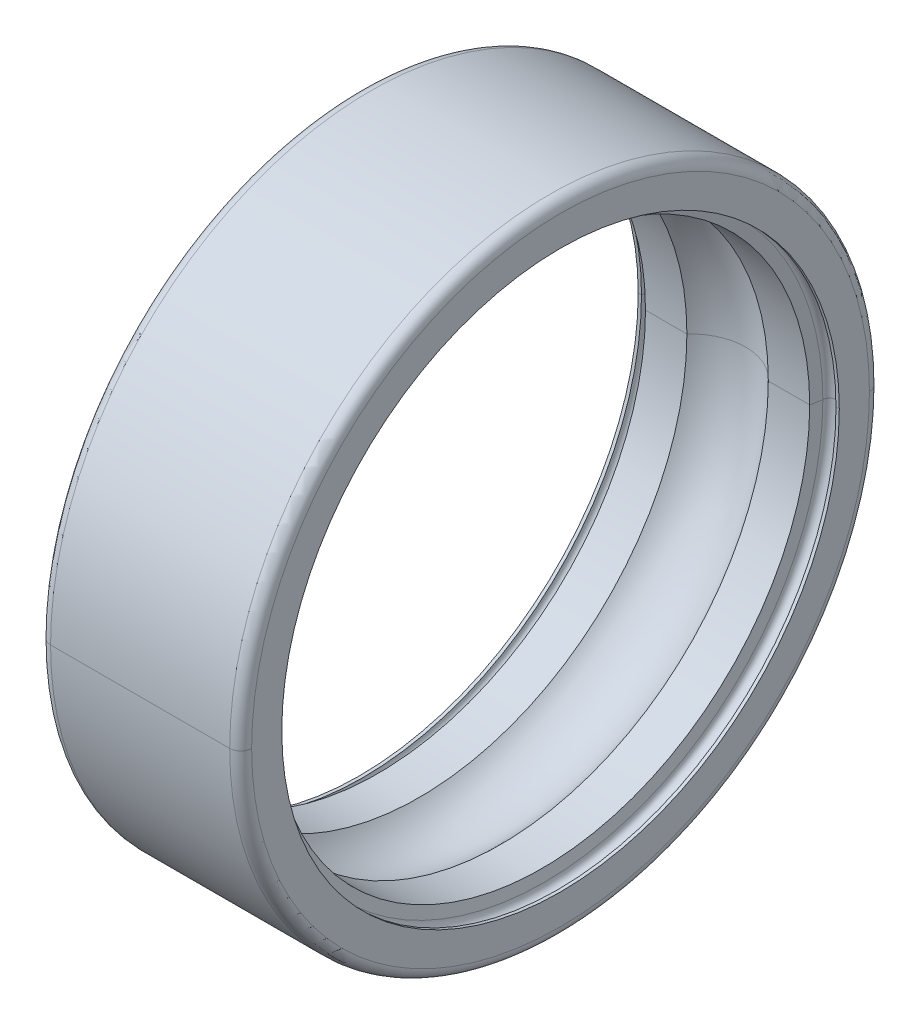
ISO-10303-21;
HEADER;
FILE_DESCRIPTION(('STEP AP214'),'2;1');
FILE_NAME('part.step','',(''),(''),'','','');
FILE_SCHEMA(('AUTOMOTIVE_DESIGN { 1 0 10303 214 1 1 1 1 }'));
ENDSEC;
DATA;
#1=APPLICATION_CONTEXT('core data for automotive mechanical design processes');
#2=APPLICATION_PROTOCOL_DEFINITION('international standard','automotive_design',2000,#1);
#3=PRODUCT_CONTEXT('',#1,'mechanical');
#4=PRODUCT('Part','Part','',(#3));
#5=PRODUCT_RELATED_PRODUCT_CATEGORY('part','',(#4));
#6=PRODUCT_DEFINITION_FORMATION('','',#4);
#7=PRODUCT_DEFINITION_CONTEXT('part definition',#1,'design');
#8=PRODUCT_DEFINITION('design','',#6,#7);
#9=PRODUCT_DEFINITION_SHAPE('','',#8);
#10=(LENGTH_UNIT() NAMED_UNIT(*) SI_UNIT(.MILLI.,.METRE.));
#11=(NAMED_UNIT(*) PLANE_ANGLE_UNIT() SI_UNIT($,.RADIAN.));
#12=(NAMED_UNIT(*) SI_UNIT($,.STERADIAN.) SOLID_ANGLE_UNIT());
#13=UNCERTAINTY_MEASURE_WITH_UNIT(LENGTH_MEASURE(1.E-05),#10,'distance_accuracy_value','');
#14=(GEOMETRIC_REPRESENTATION_CONTEXT(3) GLOBAL_UNCERTAINTY_ASSIGNED_CONTEXT((#13)) GLOBAL_UNIT_ASSIGNED_CONTEXT((#10,
#11,#12)) REPRESENTATION_CONTEXT('',''));
#15=CARTESIAN_POINT('',(0.,0.,0.));
#16=DIRECTION('',(0.,0.,1.));
#17=DIRECTION('',(1.,0.,0.));
#18=AXIS2_PLACEMENT_3D('',#15,#16,#17);
#19=CARTESIAN_POINT('',(0.,16.9,0.));
#20=DIRECTION('',(-1.,0.,0.));
#21=DIRECTION('',(0.,0.,1.));
#22=AXIS2_PLACEMENT_3D('',#19,#20,#21);
#23=PLANE('',#22);
#24=CARTESIAN_POINT('',(0.,0.,0.));
#25=DIRECTION('',(1.,0.,0.));
#26=DIRECTION('',(0.,0.,-1.));
#27=AXIS2_PLACEMENT_3D('',#24,#25,#26);
#28=CIRCLE('',#27,15.25);
#29=CARTESIAN_POINT('',(0.,0.,-15.25));
#30=VERTEX_POINT('',#29);
#31=CARTESIAN_POINT('',(0.,0.,15.25));
#32=VERTEX_POINT('',#31);
#33=EDGE_CURVE('E11',#30,#32,#28,.T.);
#34=ORIENTED_EDGE('',*,*,#33,.T.);
#35=CARTESIAN_POINT('',(0.,0.,0.));
#36=DIRECTION('',(1.,0.,0.));
#37=DIRECTION('',(0.,0.,-1.));
#38=AXIS2_PLACEMENT_3D('',#35,#36,#37);
#39=CIRCLE('',#38,15.25);
#40=EDGE_CURVE('E24',#32,#30,#39,.T.);
#41=ORIENTED_EDGE('',*,*,#40,.T.);
#42=EDGE_LOOP('',(#34,#41));
#43=FACE_BOUND('',#42,.T.);
#44=CARTESIAN_POINT('',(0.,0.,0.));
#45=DIRECTION('',(1.,0.,0.));
#46=DIRECTION('',(0.,0.,-1.));
#47=AXIS2_PLACEMENT_3D('',#44,#45,#46);
#48=CIRCLE('',#47,16.9);
#49=CARTESIAN_POINT('',(0.,0.,-16.9));
#50=VERTEX_POINT('',#49);
#51=CARTESIAN_POINT('',(-1.21014309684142E-13,0.,16.9));
#52=VERTEX_POINT('',#51);
#53=EDGE_CURVE('E581',#50,#52,#48,.T.);
#54=ORIENTED_EDGE('',*,*,#53,.F.);
#55=CARTESIAN_POINT('',(0.,0.,0.));
#56=DIRECTION('',(1.,0.,0.));
#57=DIRECTION('',(0.,0.,-1.));
#58=AXIS2_PLACEMENT_3D('',#55,#56,#57);
#59=CIRCLE('',#58,16.9);
#60=EDGE_CURVE('E579',#52,#50,#59,.T.);
#61=ORIENTED_EDGE('',*,*,#60,.F.);
#62=EDGE_LOOP('',(#54,#61));
#63=FACE_BOUND('',#62,.T.);
#64=ADVANCED_FACE('F16',(#43,#63),#23,.T.);
#65=CARTESIAN_POINT('',(0.599999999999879,0.,0.));
#66=DIRECTION('',(1.,0.,0.));
#67=DIRECTION('',(0.,1.,0.));
#68=AXIS2_PLACEMENT_3D('',#65,#66,#67);
#69=TOROIDAL_SURFACE('',#68,16.9,0.6);
#70=ORIENTED_EDGE('',*,*,#60,.T.);
#71=CARTESIAN_POINT('',(-1.20996962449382E-13,0.,-16.9));
#72=CARTESIAN_POINT('',(-2.08253385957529E-07,0.,-16.9098174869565));
#73=CARTESIAN_POINT('',(0.000240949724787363,0.,-16.9196349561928));
#74=CARTESIAN_POINT('',(0.00120450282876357,0.,-16.9392462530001));
#75=CARTESIAN_POINT('',(0.00192689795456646,0.,-16.9490400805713));
#76=CARTESIAN_POINT('',(0.00385143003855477,0.,-16.9685804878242));
#77=CARTESIAN_POINT('',(0.00505356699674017,0.,-16.9783270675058));
#78=CARTESIAN_POINT('',(0.00793462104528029,0.,-16.9977495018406));
#79=CARTESIAN_POINT('',(0.00961353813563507,0.,-17.0074253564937));
#80=CARTESIAN_POINT('',(0.0134441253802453,0.,-17.0266830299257));
#81=CARTESIAN_POINT('',(0.0155957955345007,0.,-17.0362648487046));
#82=CARTESIAN_POINT('',(0.0203667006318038,0.,-17.0553113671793));
#83=CARTESIAN_POINT('',(0.0229859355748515,0.,-17.0647760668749));
#84=CARTESIAN_POINT('',(0.0286856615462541,0.,-17.0835655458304));
#85=CARTESIAN_POINT('',(0.0317661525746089,0.,-17.0928903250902));
#86=CARTESIAN_POINT('',(0.0383809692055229,0.,-17.1113774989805));
#87=CARTESIAN_POINT('',(0.0419152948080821,0.,-17.120539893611));
#88=CARTESIAN_POINT('',(0.0494292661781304,0.,-17.1386802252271));
#89=CARTESIAN_POINT('',(0.0534089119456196,0.,-17.1476581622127));
#90=CARTESIAN_POINT('',(0.0618039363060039,0.,-17.1654079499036));
#91=CARTESIAN_POINT('',(0.0662193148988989,0.,-17.1741798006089));
#92=CARTESIAN_POINT('',(0.0754751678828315,0.,-17.1914962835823));
#93=CARTESIAN_POINT('',(0.0803156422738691,0.,-17.2000409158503));
#94=CARTESIAN_POINT('',(0.0904100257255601,0.,-17.2168823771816));
#95=CARTESIAN_POINT('',(0.0956639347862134,0.,-17.2251792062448));
#96=CARTESIAN_POINT('',(0.106572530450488,0.,-17.2415050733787));
#97=CARTESIAN_POINT('',(0.112227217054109,0.,-17.2495341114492));
#98=CARTESIAN_POINT('',(0.123923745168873,0.,-17.2653050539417));
#99=CARTESIAN_POINT('',(0.129965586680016,0.,-17.2730469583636));
#100=CARTESIAN_POINT('',(0.142421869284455,0.,-17.2882249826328));
#101=CARTESIAN_POINT('',(0.148836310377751,0.,-17.2956611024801));
#102=CARTESIAN_POINT('',(0.162022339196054,0.,-17.3102096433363));
#103=CARTESIAN_POINT('',(0.16879392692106,0.,-17.317322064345));
#104=CARTESIAN_POINT('',(0.182677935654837,0.,-17.3312060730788));
#105=CARTESIAN_POINT('',(0.189790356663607,0.,-17.3379776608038));
#106=CARTESIAN_POINT('',(0.204338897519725,0.,-17.3511636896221));
#107=CARTESIAN_POINT('',(0.211775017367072,0.,-17.3575781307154));
#108=CARTESIAN_POINT('',(0.226953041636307,0.,-17.3700344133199));
#109=CARTESIAN_POINT('',(0.234694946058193,0.,-17.376076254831));
#110=CARTESIAN_POINT('',(0.250465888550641,0.,-17.3877727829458));
#111=CARTESIAN_POINT('',(0.258494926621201,0.,-17.3934274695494));
#112=CARTESIAN_POINT('',(0.27482079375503,0.,-17.4043360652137));
#113=CARTESIAN_POINT('',(0.283117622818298,0.,-17.4095899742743));
#114=CARTESIAN_POINT('',(0.299959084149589,0.,-17.419684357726));
#115=CARTESIAN_POINT('',(0.308503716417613,0.,-17.424524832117));
#116=CARTESIAN_POINT('',(0.325820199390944,0.,-17.433780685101));
#117=CARTESIAN_POINT('',(0.334592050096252,0.,-17.4381960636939));
#118=CARTESIAN_POINT('',(0.352341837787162,0.,-17.4465910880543));
#119=CARTESIAN_POINT('',(0.361319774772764,0.,-17.4505707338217));
#120=CARTESIAN_POINT('',(0.379460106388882,0.,-17.4580847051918));
#121=CARTESIAN_POINT('',(0.388622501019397,0.,-17.4616190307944));
#122=CARTESIAN_POINT('',(0.407109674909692,0.,-17.4682338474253));
#123=CARTESIAN_POINT('',(0.416434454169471,0.,-17.4713143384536));
#124=CARTESIAN_POINT('',(0.435223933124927,0.,-17.477014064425));
#125=CARTESIAN_POINT('',(0.444688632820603,0.,-17.4796332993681));
#126=CARTESIAN_POINT('',(0.463735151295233,0.,-17.4844042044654));
#127=CARTESIAN_POINT('',(0.473316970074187,0.,-17.4865558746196));
#128=CARTESIAN_POINT('',(0.492574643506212,0.,-17.4903864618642));
#129=CARTESIAN_POINT('',(0.502250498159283,0.,-17.4920653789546));
#130=CARTESIAN_POINT('',(0.521672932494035,0.,-17.4949464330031));
#131=CARTESIAN_POINT('',(0.531419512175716,0.,-17.4961485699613));
#132=CARTESIAN_POINT('',(0.550959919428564,0.,-17.4980731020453));
#133=CARTESIAN_POINT('',(0.560753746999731,0.,-17.4987954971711));
#134=CARTESIAN_POINT('',(0.58036504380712,0.,-17.4997590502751));
#135=CARTESIAN_POINT('',(0.590182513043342,0.,-17.5000002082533));
#136=CARTESIAN_POINT('',(0.599999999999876,0.,-17.5));
#137=B_SPLINE_CURVE_WITH_KNOTS('',3,(#71,#72,#73,#74,#75,#76,#77,#78,#79,#80,#81,#82,#83,#84,
#85,#86,#87,#88,#89,#90,#91,#92,#93,#94,#95,#96,#97,#98,#99,#100,#101,#102,#103,#104,#105,#106,
#107,#108,#109,#110,#111,#112,#113,#114,#115,#116,#117,#118,#119,#120,#121,#122,#123,#124,#125,
#126,#127,#128,#129,#130,#131,#132,#133,#134,#135,#136),.UNSPECIFIED.,.F.,.F.,(4,2,2,2,2,2,2,2,
2,2,2,2,2,2,2,2,2,2,2,2,2,2,2,2,2,2,2,2,2,2,2,2,4),(0.,0.0294494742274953,0.0588989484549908,
0.0883484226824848,0.117797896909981,0.147247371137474,0.176696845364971,0.206146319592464,
0.235595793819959,0.265045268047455,0.294494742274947,0.323944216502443,0.353393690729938,
0.382843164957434,0.412292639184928,0.441742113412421,0.471191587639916,0.500641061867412,
0.530090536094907,0.559540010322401,0.588989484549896,0.618438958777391,0.647888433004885,
0.67733790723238,0.706787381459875,0.736236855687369,0.765686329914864,0.795135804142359,
0.824585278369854,0.854034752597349,0.883484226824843,0.912933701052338,0.942383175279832),.UNSPECIFIED.);
#138=CARTESIAN_POINT('',(0.600000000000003,0.,-17.5));
#139=VERTEX_POINT('',#138);
#140=EDGE_CURVE('E547',#50,#139,#137,.T.);
#141=ORIENTED_EDGE('',*,*,#140,.T.);
#142=CARTESIAN_POINT('',(0.600000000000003,0.,0.));
#143=DIRECTION('',(1.,0.,0.));
#144=DIRECTION('',(0.,0.,-1.));
#145=AXIS2_PLACEMENT_3D('',#142,#143,#144);
#146=CIRCLE('',#145,17.5);
#147=CARTESIAN_POINT('',(0.600000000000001,0.,17.5));
#148=VERTEX_POINT('',#147);
#149=EDGE_CURVE('E565',#148,#139,#146,.T.);
#150=ORIENTED_EDGE('',*,*,#149,.F.);
#151=CARTESIAN_POINT('',(-1.20996962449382E-13,0.,16.9));
#152=CARTESIAN_POINT('',(-2.08253385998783E-07,0.,16.9098174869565));
#153=CARTESIAN_POINT('',(0.000240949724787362,0.,16.9196349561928));
#154=CARTESIAN_POINT('',(0.00120450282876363,0.,16.9392462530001));
#155=CARTESIAN_POINT('',(0.0019268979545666,0.,16.9490400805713));
#156=CARTESIAN_POINT('',(0.00385143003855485,0.,16.9685804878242));
#157=CARTESIAN_POINT('',(0.00505356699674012,0.,16.9783270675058));
#158=CARTESIAN_POINT('',(0.00793462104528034,0.,16.9977495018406));
#159=CARTESIAN_POINT('',(0.00961353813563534,0.,17.0074253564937));
#160=CARTESIAN_POINT('',(0.0134441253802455,0.,17.0266830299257));
#161=CARTESIAN_POINT('',(0.0155957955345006,0.,17.0362648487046));
#162=CARTESIAN_POINT('',(0.0203667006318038,0.,17.0553113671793));
#163=CARTESIAN_POINT('',(0.0229859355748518,0.,17.0647760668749));
#164=CARTESIAN_POINT('',(0.0286856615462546,0.,17.0835655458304));
#165=CARTESIAN_POINT('',(0.0317661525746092,0.,17.0928903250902));
#166=CARTESIAN_POINT('',(0.038380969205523,0.,17.1113774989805));
#167=CARTESIAN_POINT('',(0.0419152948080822,0.,17.120539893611));
#168=CARTESIAN_POINT('',(0.0494292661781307,0.,17.1386802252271));
#169=CARTESIAN_POINT('',(0.0534089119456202,0.,17.1476581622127));
#170=CARTESIAN_POINT('',(0.0618039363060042,0.,17.1654079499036));
#171=CARTESIAN_POINT('',(0.0662193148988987,0.,17.1741798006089));
#172=CARTESIAN_POINT('',(0.0754751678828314,0.,17.1914962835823));
#173=CARTESIAN_POINT('',(0.0803156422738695,0.,17.2000409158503));
#174=CARTESIAN_POINT('',(0.0904100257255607,0.,17.2168823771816));
#175=CARTESIAN_POINT('',(0.0956639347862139,0.,17.2251792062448));
#176=CARTESIAN_POINT('',(0.106572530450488,0.,17.2415050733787));
#177=CARTESIAN_POINT('',(0.112227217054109,0.,17.2495341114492));
#178=CARTESIAN_POINT('',(0.123923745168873,0.,17.2653050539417));
#179=CARTESIAN_POINT('',(0.129965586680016,0.,17.2730469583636));
#180=CARTESIAN_POINT('',(0.142421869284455,0.,17.2882249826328));
#181=CARTESIAN_POINT('',(0.14883631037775,0.,17.2956611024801));
#182=CARTESIAN_POINT('',(0.162022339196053,0.,17.3102096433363));
#183=CARTESIAN_POINT('',(0.168793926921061,0.,17.317322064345));
#184=CARTESIAN_POINT('',(0.182677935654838,0.,17.3312060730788));
#185=CARTESIAN_POINT('',(0.189790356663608,0.,17.3379776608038));
#186=CARTESIAN_POINT('',(0.204338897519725,0.,17.3511636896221));
#187=CARTESIAN_POINT('',(0.211775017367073,0.,17.3575781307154));
#188=CARTESIAN_POINT('',(0.226953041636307,0.,17.3700344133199));
#189=CARTESIAN_POINT('',(0.234694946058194,0.,17.376076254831));
#190=CARTESIAN_POINT('',(0.250465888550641,0.,17.3877727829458));
#191=CARTESIAN_POINT('',(0.258494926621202,0.,17.3934274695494));
#192=CARTESIAN_POINT('',(0.27482079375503,0.,17.4043360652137));
#193=CARTESIAN_POINT('',(0.283117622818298,0.,17.4095899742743));
#194=CARTESIAN_POINT('',(0.29995908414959,0.,17.419684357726));
#195=CARTESIAN_POINT('',(0.308503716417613,0.,17.424524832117));
#196=CARTESIAN_POINT('',(0.325820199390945,0.,17.433780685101));
#197=CARTESIAN_POINT('',(0.334592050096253,0.,17.4381960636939));
#198=CARTESIAN_POINT('',(0.352341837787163,0.,17.4465910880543));
#199=CARTESIAN_POINT('',(0.361319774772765,0.,17.4505707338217));
#200=CARTESIAN_POINT('',(0.379460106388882,0.,17.4580847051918));
#201=CARTESIAN_POINT('',(0.388622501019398,0.,17.4616190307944));
#202=CARTESIAN_POINT('',(0.407109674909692,0.,17.4682338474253));
#203=CARTESIAN_POINT('',(0.416434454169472,0.,17.4713143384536));
#204=CARTESIAN_POINT('',(0.435223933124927,0.,17.477014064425));
#205=CARTESIAN_POINT('',(0.444688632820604,0.,17.4796332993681));
#206=CARTESIAN_POINT('',(0.463735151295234,0.,17.4844042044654));
#207=CARTESIAN_POINT('',(0.473316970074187,0.,17.4865558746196));
#208=CARTESIAN_POINT('',(0.492574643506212,0.,17.4903864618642));
#209=CARTESIAN_POINT('',(0.502250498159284,0.,17.4920653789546));
#210=CARTESIAN_POINT('',(0.521672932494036,0.,17.4949464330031));
#211=CARTESIAN_POINT('',(0.531419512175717,0.,17.4961485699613));
#212=CARTESIAN_POINT('',(0.550959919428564,0.,17.4980731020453));
#213=CARTESIAN_POINT('',(0.560753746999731,0.,17.4987954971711));
#214=CARTESIAN_POINT('',(0.580365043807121,0.,17.4997590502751));
#215=CARTESIAN_POINT('',(0.590182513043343,0.,17.5000002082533));
#216=CARTESIAN_POINT('',(0.599999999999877,0.,17.5));
#217=B_SPLINE_CURVE_WITH_KNOTS('',3,(#151,#152,#153,#154,#155,#156,#157,#158,#159,#160,#161,
#162,#163,#164,#165,#166,#167,#168,#169,#170,#171,#172,#173,#174,#175,#176,#177,#178,#179,#180,
#181,#182,#183,#184,#185,#186,#187,#188,#189,#190,#191,#192,#193,#194,#195,#196,#197,#198,#199,
#200,#201,#202,#203,#204,#205,#206,#207,#208,#209,#210,#211,#212,#213,#214,#215,#216),
.UNSPECIFIED.,.F.,.F.,(4,2,2,2,2,2,2,2,2,2,2,2,2,2,2,2,2,2,2,2,2,2,2,2,2,2,2,2,2,2,2,2,4),(0.,
0.0294494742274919,0.0588989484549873,0.0883484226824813,0.117797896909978,0.147247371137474,
0.176696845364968,0.206146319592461,0.235595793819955,0.265045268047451,0.294494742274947,
0.32394421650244,0.353393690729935,0.38284316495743,0.412292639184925,0.441742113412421,
0.471191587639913,0.500641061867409,0.530090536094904,0.559540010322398,0.588989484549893,
0.618438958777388,0.647888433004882,0.677337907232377,0.706787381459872,0.736236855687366,
0.765686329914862,0.795135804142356,0.824585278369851,0.854034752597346,0.88348422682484,
0.912933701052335,0.94238317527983),.UNSPECIFIED.);
#218=EDGE_CURVE('E550',#52,#148,#217,.T.);
#219=ORIENTED_EDGE('',*,*,#218,.F.);
#220=EDGE_LOOP('',(#70,#141,#150,#219));
#221=FACE_BOUND('',#220,.T.);
#222=ADVANCED_FACE('F531',(#221),#69,.T.);
#223=CARTESIAN_POINT('',(0.599999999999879,0.,0.));
#224=DIRECTION('',(1.,0.,0.));
#225=DIRECTION('',(0.,-1.,0.));
#226=AXIS2_PLACEMENT_3D('',#223,#224,#225);
#227=TOROIDAL_SURFACE('',#226,16.9,0.6);
#228=CARTESIAN_POINT('',(0.600000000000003,0.,0.));
#229=DIRECTION('',(1.,0.,0.));
#230=DIRECTION('',(0.,0.,-1.));
#231=AXIS2_PLACEMENT_3D('',#228,#229,#230);
#232=CIRCLE('',#231,17.5);
#233=EDGE_CURVE('E512',#139,#148,#232,.T.);
#234=ORIENTED_EDGE('',*,*,#233,.F.);
#235=ORIENTED_EDGE('',*,*,#140,.F.);
#236=ORIENTED_EDGE('',*,*,#53,.T.);
#237=ORIENTED_EDGE('',*,*,#218,.T.);
#238=EDGE_LOOP('',(#234,#235,#236,#237));
#239=FACE_BOUND('',#238,.T.);
#240=ADVANCED_FACE('F521',(#239),#227,.T.);
#241=CARTESIAN_POINT('',(50.,0.,0.));
#242=DIRECTION('',(-1.,0.,0.));
#243=DIRECTION('',(0.,-1.,0.));
#244=AXIS2_PLACEMENT_3D('',#241,#242,#243);
#245=CYLINDRICAL_SURFACE('',#244,17.5);
#246=CARTESIAN_POINT('',(10.4,0.,0.));
#247=DIRECTION('',(1.,0.,0.));
#248=DIRECTION('',(0.,0.,-1.));
#249=AXIS2_PLACEMENT_3D('',#246,#247,#248);
#250=CIRCLE('',#249,17.5);
#251=CARTESIAN_POINT('',(10.4,0.,-17.5));
#252=VERTEX_POINT('',#251);
#253=CARTESIAN_POINT('',(10.4000000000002,0.,17.5));
#254=VERTEX_POINT('',#253);
#255=EDGE_CURVE('E508',#252,#254,#250,.T.);
#256=ORIENTED_EDGE('',*,*,#255,.F.);
#257=DIRECTION('',(-1.,0.,0.));
#258=VECTOR('',#257,1.);
#259=CARTESIAN_POINT('',(10.4,0.,-17.5));
#260=LINE('',#259,#258);
#261=EDGE_CURVE('E503',#252,#139,#260,.T.);
#262=ORIENTED_EDGE('',*,*,#261,.T.);
#263=ORIENTED_EDGE('',*,*,#233,.T.);
#264=DIRECTION('',(-1.,0.,0.));
#265=VECTOR('',#264,1.);
#266=CARTESIAN_POINT('',(10.4,0.,17.5));
#267=LINE('',#266,#265);
#268=EDGE_CURVE('E498',#254,#148,#267,.T.);
#269=ORIENTED_EDGE('',*,*,#268,.F.);
#270=EDGE_LOOP('',(#256,#262,#263,#269));
#271=FACE_BOUND('',#270,.T.);
#272=ADVANCED_FACE('F530',(#271),#245,.T.);
#273=CARTESIAN_POINT('',(50.,0.,0.));
#274=DIRECTION('',(-1.,0.,0.));
#275=DIRECTION('',(0.,1.,0.));
#276=AXIS2_PLACEMENT_3D('',#273,#274,#275);
#277=CYLINDRICAL_SURFACE('',#276,17.5);
#278=ORIENTED_EDGE('',*,*,#149,.T.);
#279=ORIENTED_EDGE('',*,*,#261,.F.);
#280=CARTESIAN_POINT('',(10.4,0.,0.));
#281=DIRECTION('',(1.,0.,0.));
#282=DIRECTION('',(0.,0.,-1.));
#283=AXIS2_PLACEMENT_3D('',#280,#281,#282);
#284=CIRCLE('',#283,17.5);
#285=EDGE_CURVE('E496',#254,#252,#284,.T.);
#286=ORIENTED_EDGE('',*,*,#285,.F.);
#287=ORIENTED_EDGE('',*,*,#268,.T.);
#288=EDGE_LOOP('',(#278,#279,#286,#287));
#289=FACE_BOUND('',#288,.T.);
#290=ADVANCED_FACE('F621',(#289),#277,.T.);
#291=CARTESIAN_POINT('',(10.4000000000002,0.,0.));
#292=DIRECTION('',(1.,0.,0.));
#293=DIRECTION('',(0.,1.,0.));
#294=AXIS2_PLACEMENT_3D('',#291,#292,#293);
#295=TOROIDAL_SURFACE('',#294,16.9,0.6);
#296=ORIENTED_EDGE('',*,*,#285,.T.);
#297=CARTESIAN_POINT('',(10.4000000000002,0.,-17.5));
#298=CARTESIAN_POINT('',(10.4098174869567,0.,-17.5000002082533));
#299=CARTESIAN_POINT('',(10.419634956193,0.,-17.4997590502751));
#300=CARTESIAN_POINT('',(10.4392462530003,0.,-17.4987954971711));
#301=CARTESIAN_POINT('',(10.4490400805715,0.,-17.4980731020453));
#302=CARTESIAN_POINT('',(10.4685804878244,0.,-17.4961485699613));
#303=CARTESIAN_POINT('',(10.478327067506,0.,-17.4949464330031));
#304=CARTESIAN_POINT('',(10.4977495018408,0.,-17.4920653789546));
#305=CARTESIAN_POINT('',(10.5074253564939,0.,-17.4903864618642));
#306=CARTESIAN_POINT('',(10.5266830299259,0.,-17.4865558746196));
#307=CARTESIAN_POINT('',(10.5362648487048,0.,-17.4844042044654));
#308=CARTESIAN_POINT('',(10.5553113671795,0.,-17.4796332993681));
#309=CARTESIAN_POINT('',(10.5647760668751,0.,-17.477014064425));
#310=CARTESIAN_POINT('',(10.5835655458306,0.,-17.4713143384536));
#311=CARTESIAN_POINT('',(10.5928903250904,0.,-17.4682338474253));
#312=CARTESIAN_POINT('',(10.6113774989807,0.,-17.4616190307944));
#313=CARTESIAN_POINT('',(10.6205398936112,0.,-17.4580847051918));
#314=CARTESIAN_POINT('',(10.6386802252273,0.,-17.4505707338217));
#315=CARTESIAN_POINT('',(10.6476581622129,0.,-17.4465910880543));
#316=CARTESIAN_POINT('',(10.6654079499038,0.,-17.4381960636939));
#317=CARTESIAN_POINT('',(10.6741798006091,0.,-17.433780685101));
#318=CARTESIAN_POINT('',(10.6914962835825,0.,-17.424524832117));
#319=CARTESIAN_POINT('',(10.7000409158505,0.,-17.419684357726));
#320=CARTESIAN_POINT('',(10.7168823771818,0.,-17.4095899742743));
#321=CARTESIAN_POINT('',(10.725179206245,0.,-17.4043360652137));
#322=CARTESIAN_POINT('',(10.7415050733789,0.,-17.3934274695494));
#323=CARTESIAN_POINT('',(10.7495341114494,0.,-17.3877727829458));
#324=CARTESIAN_POINT('',(10.7653050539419,0.,-17.376076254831));
#325=CARTESIAN_POINT('',(10.7730469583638,0.,-17.3700344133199));
#326=CARTESIAN_POINT('',(10.788224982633,0.,-17.3575781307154));
#327=CARTESIAN_POINT('',(10.7956611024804,0.,-17.3511636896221));
#328=CARTESIAN_POINT('',(10.8102096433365,0.,-17.3379776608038));
#329=CARTESIAN_POINT('',(10.8173220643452,0.,-17.3312060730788));
#330=CARTESIAN_POINT('',(10.831206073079,0.,-17.317322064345));
#331=CARTESIAN_POINT('',(10.837977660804,0.,-17.3102096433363));
#332=CARTESIAN_POINT('',(10.8511636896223,0.,-17.2956611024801));
#333=CARTESIAN_POINT('',(10.8575781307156,0.,-17.2882249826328));
#334=CARTESIAN_POINT('',(10.8700344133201,0.,-17.2730469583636));
#335=CARTESIAN_POINT('',(10.8760762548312,0.,-17.2653050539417));
#336=CARTESIAN_POINT('',(10.887772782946,0.,-17.2495341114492));
#337=CARTESIAN_POINT('',(10.8934274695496,0.,-17.2415050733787));
#338=CARTESIAN_POINT('',(10.9043360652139,0.,-17.2251792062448));
#339=CARTESIAN_POINT('',(10.9095899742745,0.,-17.2168823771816));
#340=CARTESIAN_POINT('',(10.9196843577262,0.,-17.2000409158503));
#341=CARTESIAN_POINT('',(10.9245248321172,0.,-17.1914962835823));
#342=CARTESIAN_POINT('',(10.9337806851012,0.,-17.1741798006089));
#343=CARTESIAN_POINT('',(10.9381960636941,0.,-17.1654079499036));
#344=CARTESIAN_POINT('',(10.9465910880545,0.,-17.1476581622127));
#345=CARTESIAN_POINT('',(10.9505707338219,0.,-17.1386802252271));
#346=CARTESIAN_POINT('',(10.958084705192,0.,-17.120539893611));
#347=CARTESIAN_POINT('',(10.9616190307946,0.,-17.1113774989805));
#348=CARTESIAN_POINT('',(10.9682338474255,0.,-17.0928903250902));
#349=CARTESIAN_POINT('',(10.9713143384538,0.,-17.0835655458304));
#350=CARTESIAN_POINT('',(10.9770140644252,0.,-17.064776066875));
#351=CARTESIAN_POINT('',(10.9796332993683,0.,-17.0553113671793));
#352=CARTESIAN_POINT('',(10.9844042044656,0.,-17.0362648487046));
#353=CARTESIAN_POINT('',(10.9865558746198,0.,-17.0266830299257));
#354=CARTESIAN_POINT('',(10.9903864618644,0.,-17.0074253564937));
#355=CARTESIAN_POINT('',(10.9920653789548,0.,-16.9977495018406));
#356=CARTESIAN_POINT('',(10.9949464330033,0.,-16.9783270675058));
#357=CARTESIAN_POINT('',(10.9961485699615,0.,-16.9685804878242));
#358=CARTESIAN_POINT('',(10.9980731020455,0.,-16.9490400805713));
#359=CARTESIAN_POINT('',(10.9987954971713,0.,-16.9392462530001));
#360=CARTESIAN_POINT('',(10.9997590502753,0.,-16.9196349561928));
#361=CARTESIAN_POINT('',(11.0000002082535,0.,-16.9098174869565));
#362=CARTESIAN_POINT('',(11.0000000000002,0.,-16.9));
#363=B_SPLINE_CURVE_WITH_KNOTS('',3,(#297,#298,#299,#300,#301,#302,#303,#304,#305,#306,#307,
#308,#309,#310,#311,#312,#313,#314,#315,#316,#317,#318,#319,#320,#321,#322,#323,#324,#325,#326,
#327,#328,#329,#330,#331,#332,#333,#334,#335,#336,#337,#338,#339,#340,#341,#342,#343,#344,#345,
#346,#347,#348,#349,#350,#351,#352,#353,#354,#355,#356,#357,#358,#359,#360,#361,#362),
.UNSPECIFIED.,.F.,.F.,(4,2,2,2,2,2,2,2,2,2,2,2,2,2,2,2,2,2,2,2,2,2,2,2,2,2,2,2,2,2,2,2,4),(0.,
0.0294494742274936,0.0588989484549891,0.0883484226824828,0.117797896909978,0.147247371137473,
0.176696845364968,0.206146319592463,0.235595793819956,0.265045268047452,0.294494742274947,
0.323944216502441,0.353393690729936,0.38284316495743,0.412292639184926,0.441742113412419,
0.471191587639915,0.500641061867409,0.530090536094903,0.559540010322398,0.588989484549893,
0.618438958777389,0.647888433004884,0.677337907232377,0.706787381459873,0.736236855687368,
0.765686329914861,0.795135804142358,0.824585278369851,0.854034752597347,0.883484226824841,
0.912933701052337,0.942383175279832),.UNSPECIFIED.);
#364=CARTESIAN_POINT('',(11.,0.,-16.9));
#365=VERTEX_POINT('',#364);
#366=EDGE_CURVE('E464',#252,#365,#363,.T.);
#367=ORIENTED_EDGE('',*,*,#366,.T.);
#368=CARTESIAN_POINT('',(11.,0.,0.));
#369=DIRECTION('',(1.,0.,0.));
#370=DIRECTION('',(0.,0.,-1.));
#371=AXIS2_PLACEMENT_3D('',#368,#369,#370);
#372=CIRCLE('',#371,16.9);
#373=CARTESIAN_POINT('',(11.0000000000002,0.,16.9));
#374=VERTEX_POINT('',#373);
#375=EDGE_CURVE('E482',#374,#365,#372,.T.);
#376=ORIENTED_EDGE('',*,*,#375,.F.);
#377=CARTESIAN_POINT('',(10.4000000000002,0.,17.5));
#378=CARTESIAN_POINT('',(10.4098174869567,0.,17.5000002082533));
#379=CARTESIAN_POINT('',(10.419634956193,0.,17.4997590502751));
#380=CARTESIAN_POINT('',(10.4392462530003,0.,17.4987954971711));
#381=CARTESIAN_POINT('',(10.4490400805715,0.,17.4980731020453));
#382=CARTESIAN_POINT('',(10.4685804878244,0.,17.4961485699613));
#383=CARTESIAN_POINT('',(10.478327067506,0.,17.4949464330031));
#384=CARTESIAN_POINT('',(10.4977495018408,0.,17.4920653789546));
#385=CARTESIAN_POINT('',(10.5074253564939,0.,17.4903864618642));
#386=CARTESIAN_POINT('',(10.5266830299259,0.,17.4865558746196));
#387=CARTESIAN_POINT('',(10.5362648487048,0.,17.4844042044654));
#388=CARTESIAN_POINT('',(10.5553113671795,0.,17.4796332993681));
#389=CARTESIAN_POINT('',(10.5647760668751,0.,17.477014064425));
#390=CARTESIAN_POINT('',(10.5835655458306,0.,17.4713143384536));
#391=CARTESIAN_POINT('',(10.5928903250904,0.,17.4682338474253));
#392=CARTESIAN_POINT('',(10.6113774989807,0.,17.4616190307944));
#393=CARTESIAN_POINT('',(10.6205398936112,0.,17.4580847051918));
#394=CARTESIAN_POINT('',(10.6386802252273,0.,17.4505707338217));
#395=CARTESIAN_POINT('',(10.6476581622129,0.,17.4465910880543));
#396=CARTESIAN_POINT('',(10.6654079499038,0.,17.4381960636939));
#397=CARTESIAN_POINT('',(10.6741798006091,0.,17.433780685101));
#398=CARTESIAN_POINT('',(10.6914962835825,0.,17.424524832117));
#399=CARTESIAN_POINT('',(10.7000409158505,0.,17.419684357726));
#400=CARTESIAN_POINT('',(10.7168823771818,0.,17.4095899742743));
#401=CARTESIAN_POINT('',(10.725179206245,0.,17.4043360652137));
#402=CARTESIAN_POINT('',(10.7415050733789,0.,17.3934274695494));
#403=CARTESIAN_POINT('',(10.7495341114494,0.,17.3877727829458));
#404=CARTESIAN_POINT('',(10.7653050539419,0.,17.376076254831));
#405=CARTESIAN_POINT('',(10.7730469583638,0.,17.3700344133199));
#406=CARTESIAN_POINT('',(10.788224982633,0.,17.3575781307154));
#407=CARTESIAN_POINT('',(10.7956611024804,0.,17.3511636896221));
#408=CARTESIAN_POINT('',(10.8102096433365,0.,17.3379776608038));
#409=CARTESIAN_POINT('',(10.8173220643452,0.,17.3312060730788));
#410=CARTESIAN_POINT('',(10.831206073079,0.,17.317322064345));
#411=CARTESIAN_POINT('',(10.837977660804,0.,17.3102096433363));
#412=CARTESIAN_POINT('',(10.8511636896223,0.,17.2956611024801));
#413=CARTESIAN_POINT('',(10.8575781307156,0.,17.2882249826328));
#414=CARTESIAN_POINT('',(10.8700344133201,0.,17.2730469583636));
#415=CARTESIAN_POINT('',(10.8760762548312,0.,17.2653050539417));
#416=CARTESIAN_POINT('',(10.887772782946,0.,17.2495341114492));
#417=CARTESIAN_POINT('',(10.8934274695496,0.,17.2415050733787));
#418=CARTESIAN_POINT('',(10.9043360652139,0.,17.2251792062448));
#419=CARTESIAN_POINT('',(10.9095899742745,0.,17.2168823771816));
#420=CARTESIAN_POINT('',(10.9196843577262,0.,17.2000409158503));
#421=CARTESIAN_POINT('',(10.9245248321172,0.,17.1914962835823));
#422=CARTESIAN_POINT('',(10.9337806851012,0.,17.1741798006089));
#423=CARTESIAN_POINT('',(10.9381960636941,0.,17.1654079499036));
#424=CARTESIAN_POINT('',(10.9465910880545,0.,17.1476581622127));
#425=CARTESIAN_POINT('',(10.9505707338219,0.,17.1386802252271));
#426=CARTESIAN_POINT('',(10.958084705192,0.,17.120539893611));
#427=CARTESIAN_POINT('',(10.9616190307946,0.,17.1113774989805));
#428=CARTESIAN_POINT('',(10.9682338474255,0.,17.0928903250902));
#429=CARTESIAN_POINT('',(10.9713143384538,0.,17.0835655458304));
#430=CARTESIAN_POINT('',(10.9770140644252,0.,17.0647760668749));
#431=CARTESIAN_POINT('',(10.9796332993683,0.,17.0553113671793));
#432=CARTESIAN_POINT('',(10.9844042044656,0.,17.0362648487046));
#433=CARTESIAN_POINT('',(10.9865558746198,0.,17.0266830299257));
#434=CARTESIAN_POINT('',(10.9903864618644,0.,17.0074253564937));
#435=CARTESIAN_POINT('',(10.9920653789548,0.,16.9977495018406));
#436=CARTESIAN_POINT('',(10.9949464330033,0.,16.9783270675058));
#437=CARTESIAN_POINT('',(10.9961485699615,0.,16.9685804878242));
#438=CARTESIAN_POINT('',(10.9980731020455,0.,16.9490400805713));
#439=CARTESIAN_POINT('',(10.9987954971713,0.,16.9392462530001));
#440=CARTESIAN_POINT('',(10.9997590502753,0.,16.9196349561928));
#441=CARTESIAN_POINT('',(11.0000002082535,0.,16.9098174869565));
#442=CARTESIAN_POINT('',(11.0000000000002,0.,16.9));
#443=B_SPLINE_CURVE_WITH_KNOTS('',3,(#377,#378,#379,#380,#381,#382,#383,#384,#385,#386,#387,
#388,#389,#390,#391,#392,#393,#394,#395,#396,#397,#398,#399,#400,#401,#402,#403,#404,#405,#406,
#407,#408,#409,#410,#411,#412,#413,#414,#415,#416,#417,#418,#419,#420,#421,#422,#423,#424,#425,
#426,#427,#428,#429,#430,#431,#432,#433,#434,#435,#436,#437,#438,#439,#440,#441,#442),
.UNSPECIFIED.,.F.,.F.,(4,2,2,2,2,2,2,2,2,2,2,2,2,2,2,2,2,2,2,2,2,2,2,2,2,2,2,2,2,2,2,2,4),(0.,
0.0294494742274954,0.0588989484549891,0.0883484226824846,0.11779789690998,0.147247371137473,
0.176696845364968,0.206146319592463,0.235595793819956,0.265045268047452,0.294494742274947,
0.323944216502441,0.353393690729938,0.38284316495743,0.412292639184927,0.441742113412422,
0.471191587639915,0.500641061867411,0.530090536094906,0.559540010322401,0.588989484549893,
0.618438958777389,0.647888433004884,0.67733790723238,0.706787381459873,0.736236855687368,
0.765686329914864,0.795135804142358,0.824585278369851,0.854034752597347,0.883484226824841,
0.912933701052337,0.942383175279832),.UNSPECIFIED.);
#444=EDGE_CURVE('E467',#254,#374,#443,.T.);
#445=ORIENTED_EDGE('',*,*,#444,.F.);
#446=EDGE_LOOP('',(#296,#367,#376,#445));
#447=FACE_BOUND('',#446,.T.);
#448=ADVANCED_FACE('F446',(#447),#295,.T.);
#449=CARTESIAN_POINT('',(10.4000000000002,0.,0.));
#450=DIRECTION('',(1.,0.,0.));
#451=DIRECTION('',(0.,-1.,0.));
#452=AXIS2_PLACEMENT_3D('',#449,#450,#451);
#453=TOROIDAL_SURFACE('',#452,16.9,0.6);
#454=CARTESIAN_POINT('',(11.,0.,0.));
#455=DIRECTION('',(1.,0.,0.));
#456=DIRECTION('',(0.,0.,-1.));
#457=AXIS2_PLACEMENT_3D('',#454,#455,#456);
#458=CIRCLE('',#457,16.9);
#459=EDGE_CURVE('E426',#365,#374,#458,.T.);
#460=ORIENTED_EDGE('',*,*,#459,.F.);
#461=ORIENTED_EDGE('',*,*,#366,.F.);
#462=ORIENTED_EDGE('',*,*,#255,.T.);
#463=ORIENTED_EDGE('',*,*,#444,.T.);
#464=EDGE_LOOP('',(#460,#461,#462,#463));
#465=FACE_BOUND('',#464,.T.);
#466=ADVANCED_FACE('F435',(#465),#453,.T.);
#467=CARTESIAN_POINT('',(11.,15.25,0.));
#468=DIRECTION('',(1.,0.,0.));
#469=DIRECTION('',(0.,0.,-1.));
#470=AXIS2_PLACEMENT_3D('',#467,#468,#469);
#471=PLANE('',#470);
#472=ORIENTED_EDGE('',*,*,#459,.T.);
#473=ORIENTED_EDGE('',*,*,#375,.T.);
#474=EDGE_LOOP('',(#472,#473));
#475=FACE_BOUND('',#474,.T.);
#476=CARTESIAN_POINT('',(11.,0.,0.));
#477=DIRECTION('',(1.,0.,0.));
#478=DIRECTION('',(0.,0.,-1.));
#479=AXIS2_PLACEMENT_3D('',#476,#477,#478);
#480=CIRCLE('',#479,15.25);
#481=CARTESIAN_POINT('',(11.,0.,-15.25));
#482=VERTEX_POINT('',#481);
#483=CARTESIAN_POINT('',(11.,0.,15.25));
#484=VERTEX_POINT('',#483);
#485=EDGE_CURVE('E421',#482,#484,#480,.T.);
#486=ORIENTED_EDGE('',*,*,#485,.F.);
#487=CARTESIAN_POINT('',(11.,0.,0.));
#488=DIRECTION('',(1.,0.,0.));
#489=DIRECTION('',(0.,0.,-1.));
#490=AXIS2_PLACEMENT_3D('',#487,#488,#489);
#491=CIRCLE('',#490,15.25);
#492=EDGE_CURVE('E416',#484,#482,#491,.T.);
#493=ORIENTED_EDGE('',*,*,#492,.F.);
#494=EDGE_LOOP('',(#486,#493));
#495=FACE_BOUND('',#494,.T.);
#496=ADVANCED_FACE('F445',(#475,#495),#471,.T.);
#497=CARTESIAN_POINT('',(50.,0.,0.));
#498=DIRECTION('',(-1.,0.,0.));
#499=DIRECTION('',(0.,1.,0.));
#500=AXIS2_PLACEMENT_3D('',#497,#498,#499);
#501=CYLINDRICAL_SURFACE('',#500,15.25);
#502=CARTESIAN_POINT('',(10.82,0.,0.));
#503=DIRECTION('',(1.,0.,0.));
#504=DIRECTION('',(0.,0.,-1.));
#505=AXIS2_PLACEMENT_3D('',#502,#503,#504);
#506=CIRCLE('',#505,15.25);
#507=CARTESIAN_POINT('',(10.82,0.,15.25));
#508=VERTEX_POINT('',#507);
#509=CARTESIAN_POINT('',(10.82,0.,-15.25));
#510=VERTEX_POINT('',#509);
#511=EDGE_CURVE('E412',#508,#510,#506,.T.);
#512=ORIENTED_EDGE('',*,*,#511,.F.);
#513=DIRECTION('',(-1.,0.,0.));
#514=VECTOR('',#513,1.);
#515=CARTESIAN_POINT('',(11.,0.,15.25));
#516=LINE('',#515,#514);
#517=EDGE_CURVE('E407',#484,#508,#516,.T.);
#518=ORIENTED_EDGE('',*,*,#517,.F.);
#519=ORIENTED_EDGE('',*,*,#492,.T.);
#520=DIRECTION('',(-1.,0.,0.));
#521=VECTOR('',#520,1.);
#522=CARTESIAN_POINT('',(11.,0.,-15.25));
#523=LINE('',#522,#521);
#524=EDGE_CURVE('E403',#482,#510,#523,.T.);
#525=ORIENTED_EDGE('',*,*,#524,.T.);
#526=EDGE_LOOP('',(#512,#518,#519,#525));
#527=FACE_BOUND('',#526,.T.);
#528=ADVANCED_FACE('F651',(#527),#501,.F.);
#529=CARTESIAN_POINT('',(50.,0.,0.));
#530=DIRECTION('',(-1.,0.,0.));
#531=DIRECTION('',(0.,-1.,0.));
#532=AXIS2_PLACEMENT_3D('',#529,#530,#531);
#533=CYLINDRICAL_SURFACE('',#532,15.25);
#534=ORIENTED_EDGE('',*,*,#485,.T.);
#535=ORIENTED_EDGE('',*,*,#517,.T.);
#536=CARTESIAN_POINT('',(10.82,0.,0.));
#537=DIRECTION('',(1.,0.,0.));
#538=DIRECTION('',(0.,0.,-1.));
#539=AXIS2_PLACEMENT_3D('',#536,#537,#538);
#540=CIRCLE('',#539,15.25);
#541=EDGE_CURVE('E401',#510,#508,#540,.T.);
#542=ORIENTED_EDGE('',*,*,#541,.F.);
#543=ORIENTED_EDGE('',*,*,#524,.F.);
#544=EDGE_LOOP('',(#534,#535,#542,#543));
#545=FACE_BOUND('',#544,.T.);
#546=ADVANCED_FACE('F660',(#545),#533,.F.);
#547=CARTESIAN_POINT('',(10.46,0.,0.));
#548=DIRECTION('',(1.,0.,0.));
#549=DIRECTION('',(0.,-1.,0.));
#550=AXIS2_PLACEMENT_3D('',#547,#548,#549);
#551=TOROIDAL_SURFACE('',#550,15.250000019,0.36);
#552=ORIENTED_EDGE('',*,*,#541,.T.);
#553=CARTESIAN_POINT('',(10.1,0.,15.25));
#554=CARTESIAN_POINT('',(10.0999998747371,0.,15.2558904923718));
#555=CARTESIAN_POINT('',(10.1001445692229,0.,15.2617809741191));
#556=CARTESIAN_POINT('',(10.1007227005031,0.,15.2735477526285));
#557=CARTESIAN_POINT('',(10.1011561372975,0.,15.2794240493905));
#558=CARTESIAN_POINT('',(10.1023108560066,0.,15.2911482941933));
#559=CARTESIAN_POINT('',(10.1030321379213,0.,15.296996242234));
#560=CARTESIAN_POINT('',(10.1047607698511,0.,15.3086497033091));
#561=CARTESIAN_POINT('',(10.1057681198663,0.,15.3144552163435));
#562=CARTESIAN_POINT('',(10.1080664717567,0.,15.326009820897));
#563=CARTESIAN_POINT('',(10.1093574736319,0.,15.3317589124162));
#564=CARTESIAN_POINT('',(10.1122200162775,0.,15.3431868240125));
#565=CARTESIAN_POINT('',(10.113791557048,0.,15.3488656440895));
#566=CARTESIAN_POINT('',(10.1172113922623,0.,15.3601393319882));
#567=CARTESIAN_POINT('',(10.1190596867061,0.,15.3657341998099));
#568=CARTESIAN_POINT('',(10.1230285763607,0.,15.3768265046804));
#569=CARTESIAN_POINT('',(10.1251491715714,0.,15.3823239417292));
#570=CARTESIAN_POINT('',(10.129657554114,0.,15.3932081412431));
#571=CARTESIAN_POINT('',(10.132045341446,0.,15.3985949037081));
#572=CARTESIAN_POINT('',(10.1370823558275,0.,15.4092447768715));
#573=CARTESIAN_POINT('',(10.139731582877,0.,15.41450788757));
#574=CARTESIAN_POINT('',(10.145285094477,0.,15.4248977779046));
#575=CARTESIAN_POINT('',(10.1481893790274,0.,15.4300245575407));
#576=CARTESIAN_POINT('',(10.1542460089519,0.,15.4401294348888));
#577=CARTESIAN_POINT('',(10.157398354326,0.,15.4451075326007));
#578=CARTESIAN_POINT('',(10.1639435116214,0.,15.454903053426));
#579=CARTESIAN_POINT('',(10.1673363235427,0.,15.4597204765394));
#580=CARTESIAN_POINT('',(10.1743542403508,0.,15.4691830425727));
#581=CARTESIAN_POINT('',(10.1779793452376,0.,15.4738281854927));
#582=CARTESIAN_POINT('',(10.185453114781,0.,15.4829350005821));
#583=CARTESIAN_POINT('',(10.1893017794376,0.,15.4873966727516));
#584=CARTESIAN_POINT('',(10.1972133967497,0.,15.4961257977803));
#585=CARTESIAN_POINT('',(10.2012763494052,0.,15.5003932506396));
#586=CARTESIAN_POINT('',(10.2096067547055,0.,15.5087236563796));
#587=CARTESIAN_POINT('',(10.2138742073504,0.,15.5127866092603));
#588=CARTESIAN_POINT('',(10.2226033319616,0.,15.5206982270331));
#589=CARTESIAN_POINT('',(10.227065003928,0.,15.5245468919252));
#590=CARTESIAN_POINT('',(10.2361718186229,0.,15.5320206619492));
#591=CARTESIAN_POINT('',(10.2408169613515,0.,15.5356457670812));
#592=CARTESIAN_POINT('',(10.2502795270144,0.,15.5426636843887));
#593=CARTESIAN_POINT('',(10.2550969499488,0.,15.5460564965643));
#594=CARTESIAN_POINT('',(10.2648924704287,0.,15.5526016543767));
#595=CARTESIAN_POINT('',(10.2698705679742,0.,15.5557540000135));
#596=CARTESIAN_POINT('',(10.2799754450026,0.,15.5618106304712));
#597=CARTESIAN_POINT('',(10.2851022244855,0.,15.5647149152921));
#598=CARTESIAN_POINT('',(10.295492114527,0.,15.5702684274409));
#599=CARTESIAN_POINT('',(10.3007552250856,0.,15.5729176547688));
#600=CARTESIAN_POINT('',(10.3114050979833,0.,15.5779546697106));
#601=CARTESIAN_POINT('',(10.3167918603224,0.,15.5803424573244));
#602=CARTESIAN_POINT('',(10.3276760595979,0.,15.5848508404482));
#603=CARTESIAN_POINT('',(10.3331734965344,0.,15.5869714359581));
#604=CARTESIAN_POINT('',(10.3442658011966,0.,15.5909403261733));
#605=CARTESIAN_POINT('',(10.3498606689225,0.,15.5927886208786));
#606=CARTESIAN_POINT('',(10.3611343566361,0.,15.5962084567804));
#607=CARTESIAN_POINT('',(10.366813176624,0.,15.5977799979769));
#608=CARTESIAN_POINT('',(10.3782410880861,0.,15.6006425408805));
#609=CARTESIAN_POINT('',(10.3839901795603,0.,15.6019335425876));
#610=CARTESIAN_POINT('',(10.3955447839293,0.,15.604231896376));
#611=CARTESIAN_POINT('',(10.4013502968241,0.,15.6052392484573));
#612=CARTESIAN_POINT('',(10.4130037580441,0.,15.6069678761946));
#613=CARTESIAN_POINT('',(10.4188517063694,0.,15.6076891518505));
#614=CARTESIAN_POINT('',(10.4305759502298,0.,15.6088438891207));
#615=CARTESIAN_POINT('',(10.4364522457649,0.,15.6092773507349));
#616=CARTESIAN_POINT('',(10.4482190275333,0.,15.6098554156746));
#617=CARTESIAN_POINT('',(10.4541095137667,0.,15.610000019));
#618=CARTESIAN_POINT('',(10.4658904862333,0.,15.610000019));
#619=CARTESIAN_POINT('',(10.4717809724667,0.,15.6098554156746));
#620=CARTESIAN_POINT('',(10.4835477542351,0.,15.6092773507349));
#621=CARTESIAN_POINT('',(10.4894240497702,0.,15.6088438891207));
#622=CARTESIAN_POINT('',(10.5011482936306,0.,15.6076891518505));
#623=CARTESIAN_POINT('',(10.5069962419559,0.,15.6069678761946));
#624=CARTESIAN_POINT('',(10.5186497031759,0.,15.6052392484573));
#625=CARTESIAN_POINT('',(10.5244552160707,0.,15.604231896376));
#626=CARTESIAN_POINT('',(10.5360098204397,0.,15.6019335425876));
#627=CARTESIAN_POINT('',(10.5417589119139,0.,15.6006425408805));
#628=CARTESIAN_POINT('',(10.553186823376,0.,15.5977799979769));
#629=CARTESIAN_POINT('',(10.5588656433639,0.,15.5962084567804));
#630=CARTESIAN_POINT('',(10.5701393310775,0.,15.5927886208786));
#631=CARTESIAN_POINT('',(10.5757341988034,0.,15.5909403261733));
#632=CARTESIAN_POINT('',(10.5868265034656,0.,15.5869714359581));
#633=CARTESIAN_POINT('',(10.5923239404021,0.,15.5848508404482));
#634=CARTESIAN_POINT('',(10.6032081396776,0.,15.5803424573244));
#635=CARTESIAN_POINT('',(10.6085949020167,0.,15.5779546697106));
#636=CARTESIAN_POINT('',(10.6192447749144,0.,15.5729176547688));
#637=CARTESIAN_POINT('',(10.624507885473,0.,15.5702684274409));
#638=CARTESIAN_POINT('',(10.6348977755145,0.,15.5647149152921));
#639=CARTESIAN_POINT('',(10.6400245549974,0.,15.5618106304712));
#640=CARTESIAN_POINT('',(10.6501294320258,0.,15.5557540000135));
#641=CARTESIAN_POINT('',(10.6551075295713,0.,15.5526016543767));
#642=CARTESIAN_POINT('',(10.6649030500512,0.,15.5460564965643));
#643=CARTESIAN_POINT('',(10.6697204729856,0.,15.5426636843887));
#644=CARTESIAN_POINT('',(10.6791830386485,0.,15.5356457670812));
#645=CARTESIAN_POINT('',(10.6838281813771,0.,15.5320206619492));
#646=CARTESIAN_POINT('',(10.692934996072,0.,15.5245468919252));
#647=CARTESIAN_POINT('',(10.6973966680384,0.,15.5206982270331));
#648=CARTESIAN_POINT('',(10.7061257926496,0.,15.5127866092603));
#649=CARTESIAN_POINT('',(10.7103932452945,0.,15.5087236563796));
#650=CARTESIAN_POINT('',(10.7187236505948,0.,15.5003932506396));
#651=CARTESIAN_POINT('',(10.7227866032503,0.,15.4961257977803));
#652=CARTESIAN_POINT('',(10.7306982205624,0.,15.4873966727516));
#653=CARTESIAN_POINT('',(10.734546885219,0.,15.4829350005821));
#654=CARTESIAN_POINT('',(10.7420206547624,0.,15.4738281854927));
#655=CARTESIAN_POINT('',(10.7456457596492,0.,15.4691830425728));
#656=CARTESIAN_POINT('',(10.7526636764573,0.,15.4597204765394));
#657=CARTESIAN_POINT('',(10.7560564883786,0.,15.454903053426));
#658=CARTESIAN_POINT('',(10.762601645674,0.,15.4451075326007));
#659=CARTESIAN_POINT('',(10.7657539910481,0.,15.4401294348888));
#660=CARTESIAN_POINT('',(10.7718106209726,0.,15.4300245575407));
#661=CARTESIAN_POINT('',(10.774714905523,0.,15.4248977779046));
#662=CARTESIAN_POINT('',(10.780268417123,0.,15.41450788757));
#663=CARTESIAN_POINT('',(10.7829176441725,0.,15.4092447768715));
#664=CARTESIAN_POINT('',(10.787954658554,0.,15.3985949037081));
#665=CARTESIAN_POINT('',(10.790342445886,0.,15.3932081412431));
#666=CARTESIAN_POINT('',(10.7948508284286,0.,15.3823239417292));
#667=CARTESIAN_POINT('',(10.7969714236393,0.,15.3768265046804));
#668=CARTESIAN_POINT('',(10.8009403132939,0.,15.3657341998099));
#669=CARTESIAN_POINT('',(10.8027886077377,0.,15.3601393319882));
#670=CARTESIAN_POINT('',(10.806208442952,0.,15.3488656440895));
#671=CARTESIAN_POINT('',(10.8077799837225,0.,15.3431868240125));
#672=CARTESIAN_POINT('',(10.8106425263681,0.,15.3317589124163));
#673=CARTESIAN_POINT('',(10.8119335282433,0.,15.326009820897));
#674=CARTESIAN_POINT('',(10.8142318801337,0.,15.3144552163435));
#675=CARTESIAN_POINT('',(10.8152392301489,0.,15.3086497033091));
#676=CARTESIAN_POINT('',(10.8169678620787,0.,15.296996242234));
#677=CARTESIAN_POINT('',(10.8176891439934,0.,15.2911482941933));
#678=CARTESIAN_POINT('',(10.8188438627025,0.,15.2794240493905));
#679=CARTESIAN_POINT('',(10.8192772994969,0.,15.2735477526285));
#680=CARTESIAN_POINT('',(10.8198554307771,0.,15.2617809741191));
#681=CARTESIAN_POINT('',(10.8200001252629,0.,15.2558904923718));
#682=CARTESIAN_POINT('',(10.82,0.,15.25));
#683=B_SPLINE_CURVE_WITH_KNOTS('',3,(#553,#554,#555,#556,#557,#558,#559,#560,#561,#562,#563,
#564,#565,#566,#567,#568,#569,#570,#571,#572,#573,#574,#575,#576,#577,#578,#579,#580,#581,#582,
#583,#584,#585,#586,#587,#588,#589,#590,#591,#592,#593,#594,#595,#596,#597,#598,#599,#600,#601,
#602,#603,#604,#605,#606,#607,#608,#609,#610,#611,#612,#613,#614,#615,#616,#617,#618,#619,#620,
#621,#622,#623,#624,#625,#626,#627,#628,#629,#630,#631,#632,#633,#634,#635,#636,#637,#638,#639,
#640,#641,#642,#643,#644,#645,#646,#647,#648,#649,#650,#651,#652,#653,#654,#655,#656,#657,#658,
#659,#660,#661,#662,#663,#664,#665,#666,#667,#668,#669,#670,#671,#672,#673,#674,#675,#676,#677,
#678,#679,#680,#681,#682),.UNSPECIFIED.,.F.,.F.,(4,2,2,2,2,2,2,2,2,2,2,2,2,2,2,2,2,2,2,2,2,2,2,
2,2,2,2,2,2,2,2,2,2,2,2,2,2,2,2,2,2,2,2,2,2,2,2,2,2,2,2,2,2,2,2,2,2,2,2,2,2,2,2,2,4),(0.,
0.0176696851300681,0.0353393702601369,0.0530090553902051,0.0706787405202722,0.0883484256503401,
0.106018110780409,0.123687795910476,0.141357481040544,0.159027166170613,0.176696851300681,
0.194366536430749,0.212036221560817,0.229705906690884,0.247375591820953,0.265045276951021,
0.282714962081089,0.300384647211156,0.318054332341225,0.335724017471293,0.353393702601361,
0.371063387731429,0.388733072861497,0.406402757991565,0.424072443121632,0.4417421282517,
0.459411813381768,0.477081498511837,0.494751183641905,0.512420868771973,0.53009055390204,
0.54776023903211,0.565429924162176,0.583099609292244,0.600769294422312,0.618438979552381,
0.636108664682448,0.653778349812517,0.671448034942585,0.689117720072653,0.706787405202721,
0.724457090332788,0.742126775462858,0.759796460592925,0.777466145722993,0.79513583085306,
0.812805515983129,0.830475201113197,0.848144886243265,0.865814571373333,0.8834842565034,
0.901153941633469,0.918823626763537,0.936493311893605,0.954162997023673,0.971832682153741,
0.98950236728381,1.00717205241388,1.02484173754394,1.04251142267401,1.06018110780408,
1.07785079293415,1.09552047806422,1.11319016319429,1.13085984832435),.UNSPECIFIED.);
#684=CARTESIAN_POINT('',(10.0999999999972,0.,15.2500000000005));
#685=VERTEX_POINT('',#684);
#686=EDGE_CURVE('E369',#685,#508,#683,.T.);
#687=ORIENTED_EDGE('',*,*,#686,.F.);
#688=CARTESIAN_POINT('',(10.1,0.,0.));
#689=DIRECTION('',(1.,0.,0.));
#690=DIRECTION('',(0.,0.,-1.));
#691=AXIS2_PLACEMENT_3D('',#688,#689,#690);
#692=CIRCLE('',#691,15.25);
#693=CARTESIAN_POINT('',(10.1,0.,-15.25));
#694=VERTEX_POINT('',#693);
#695=EDGE_CURVE('E387',#694,#685,#692,.T.);
#696=ORIENTED_EDGE('',*,*,#695,.F.);
#697=CARTESIAN_POINT('',(10.1,0.,-15.25));
#698=CARTESIAN_POINT('',(10.0999998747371,0.,-15.2558904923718));
#699=CARTESIAN_POINT('',(10.1001445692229,0.,-15.2617809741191));
#700=CARTESIAN_POINT('',(10.1007227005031,0.,-15.2735477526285));
#701=CARTESIAN_POINT('',(10.1011561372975,0.,-15.2794240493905));
#702=CARTESIAN_POINT('',(10.1023108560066,0.,-15.2911482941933));
#703=CARTESIAN_POINT('',(10.1030321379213,0.,-15.296996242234));
#704=CARTESIAN_POINT('',(10.1047607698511,0.,-15.3086497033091));
#705=CARTESIAN_POINT('',(10.1057681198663,0.,-15.3144552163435));
#706=CARTESIAN_POINT('',(10.1080664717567,0.,-15.326009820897));
#707=CARTESIAN_POINT('',(10.1093574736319,0.,-15.3317589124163));
#708=CARTESIAN_POINT('',(10.1122200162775,0.,-15.3431868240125));
#709=CARTESIAN_POINT('',(10.113791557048,0.,-15.3488656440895));
#710=CARTESIAN_POINT('',(10.1172113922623,0.,-15.3601393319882));
#711=CARTESIAN_POINT('',(10.1190596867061,0.,-15.3657341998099));
#712=CARTESIAN_POINT('',(10.1230285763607,0.,-15.3768265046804));
#713=CARTESIAN_POINT('',(10.1251491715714,0.,-15.3823239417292));
#714=CARTESIAN_POINT('',(10.129657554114,0.,-15.3932081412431));
#715=CARTESIAN_POINT('',(10.132045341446,0.,-15.3985949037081));
#716=CARTESIAN_POINT('',(10.1370823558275,0.,-15.4092447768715));
#717=CARTESIAN_POINT('',(10.139731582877,0.,-15.41450788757));
#718=CARTESIAN_POINT('',(10.145285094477,0.,-15.4248977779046));
#719=CARTESIAN_POINT('',(10.1481893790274,0.,-15.4300245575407));
#720=CARTESIAN_POINT('',(10.1542460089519,0.,-15.4401294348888));
#721=CARTESIAN_POINT('',(10.157398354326,0.,-15.4451075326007));
#722=CARTESIAN_POINT('',(10.1639435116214,0.,-15.454903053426));
#723=CARTESIAN_POINT('',(10.1673363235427,0.,-15.4597204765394));
#724=CARTESIAN_POINT('',(10.1743542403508,0.,-15.4691830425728));
#725=CARTESIAN_POINT('',(10.1779793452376,0.,-15.4738281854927));
#726=CARTESIAN_POINT('',(10.185453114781,0.,-15.4829350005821));
#727=CARTESIAN_POINT('',(10.1893017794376,0.,-15.4873966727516));
#728=CARTESIAN_POINT('',(10.1972133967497,0.,-15.4961257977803));
#729=CARTESIAN_POINT('',(10.2012763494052,0.,-15.5003932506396));
#730=CARTESIAN_POINT('',(10.2096067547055,0.,-15.5087236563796));
#731=CARTESIAN_POINT('',(10.2138742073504,0.,-15.5127866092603));
#732=CARTESIAN_POINT('',(10.2226033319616,0.,-15.5206982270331));
#733=CARTESIAN_POINT('',(10.227065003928,0.,-15.5245468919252));
#734=CARTESIAN_POINT('',(10.2361718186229,0.,-15.5320206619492));
#735=CARTESIAN_POINT('',(10.2408169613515,0.,-15.5356457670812));
#736=CARTESIAN_POINT('',(10.2502795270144,0.,-15.5426636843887));
#737=CARTESIAN_POINT('',(10.2550969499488,0.,-15.5460564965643));
#738=CARTESIAN_POINT('',(10.2648924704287,0.,-15.5526016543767));
#739=CARTESIAN_POINT('',(10.2698705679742,0.,-15.5557540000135));
#740=CARTESIAN_POINT('',(10.2799754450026,0.,-15.5618106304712));
#741=CARTESIAN_POINT('',(10.2851022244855,0.,-15.5647149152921));
#742=CARTESIAN_POINT('',(10.295492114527,0.,-15.5702684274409));
#743=CARTESIAN_POINT('',(10.3007552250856,0.,-15.5729176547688));
#744=CARTESIAN_POINT('',(10.3114050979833,0.,-15.5779546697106));
#745=CARTESIAN_POINT('',(10.3167918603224,0.,-15.5803424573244));
#746=CARTESIAN_POINT('',(10.3276760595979,0.,-15.5848508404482));
#747=CARTESIAN_POINT('',(10.3331734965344,0.,-15.5869714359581));
#748=CARTESIAN_POINT('',(10.3442658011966,0.,-15.5909403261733));
#749=CARTESIAN_POINT('',(10.3498606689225,0.,-15.5927886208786));
#750=CARTESIAN_POINT('',(10.3611343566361,0.,-15.5962084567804));
#751=CARTESIAN_POINT('',(10.366813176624,0.,-15.5977799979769));
#752=CARTESIAN_POINT('',(10.3782410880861,0.,-15.6006425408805));
#753=CARTESIAN_POINT('',(10.3839901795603,0.,-15.6019335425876));
#754=CARTESIAN_POINT('',(10.3955447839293,0.,-15.604231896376));
#755=CARTESIAN_POINT('',(10.4013502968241,0.,-15.6052392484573));
#756=CARTESIAN_POINT('',(10.4130037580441,0.,-15.6069678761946));
#757=CARTESIAN_POINT('',(10.4188517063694,0.,-15.6076891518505));
#758=CARTESIAN_POINT('',(10.4305759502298,0.,-15.6088438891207));
#759=CARTESIAN_POINT('',(10.4364522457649,0.,-15.6092773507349));
#760=CARTESIAN_POINT('',(10.4482190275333,0.,-15.6098554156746));
#761=CARTESIAN_POINT('',(10.4541095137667,0.,-15.610000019));
#762=CARTESIAN_POINT('',(10.4658904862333,0.,-15.610000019));
#763=CARTESIAN_POINT('',(10.4717809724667,0.,-15.6098554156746));
#764=CARTESIAN_POINT('',(10.4835477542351,0.,-15.6092773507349));
#765=CARTESIAN_POINT('',(10.4894240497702,0.,-15.6088438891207));
#766=CARTESIAN_POINT('',(10.5011482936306,0.,-15.6076891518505));
#767=CARTESIAN_POINT('',(10.5069962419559,0.,-15.6069678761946));
#768=CARTESIAN_POINT('',(10.5186497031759,0.,-15.6052392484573));
#769=CARTESIAN_POINT('',(10.5244552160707,0.,-15.604231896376));
#770=CARTESIAN_POINT('',(10.5360098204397,0.,-15.6019335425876));
#771=CARTESIAN_POINT('',(10.5417589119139,0.,-15.6006425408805));
#772=CARTESIAN_POINT('',(10.553186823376,0.,-15.5977799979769));
#773=CARTESIAN_POINT('',(10.5588656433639,0.,-15.5962084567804));
#774=CARTESIAN_POINT('',(10.5701393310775,0.,-15.5927886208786));
#775=CARTESIAN_POINT('',(10.5757341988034,0.,-15.5909403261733));
#776=CARTESIAN_POINT('',(10.5868265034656,0.,-15.5869714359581));
#777=CARTESIAN_POINT('',(10.5923239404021,0.,-15.5848508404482));
#778=CARTESIAN_POINT('',(10.6032081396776,0.,-15.5803424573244));
#779=CARTESIAN_POINT('',(10.6085949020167,0.,-15.5779546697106));
#780=CARTESIAN_POINT('',(10.6192447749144,0.,-15.5729176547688));
#781=CARTESIAN_POINT('',(10.624507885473,0.,-15.5702684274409));
#782=CARTESIAN_POINT('',(10.6348977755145,0.,-15.5647149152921));
#783=CARTESIAN_POINT('',(10.6400245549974,0.,-15.5618106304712));
#784=CARTESIAN_POINT('',(10.6501294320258,0.,-15.5557540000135));
#785=CARTESIAN_POINT('',(10.6551075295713,0.,-15.5526016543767));
#786=CARTESIAN_POINT('',(10.6649030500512,0.,-15.5460564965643));
#787=CARTESIAN_POINT('',(10.6697204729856,0.,-15.5426636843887));
#788=CARTESIAN_POINT('',(10.6791830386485,0.,-15.5356457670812));
#789=CARTESIAN_POINT('',(10.6838281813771,0.,-15.5320206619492));
#790=CARTESIAN_POINT('',(10.692934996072,0.,-15.5245468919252));
#791=CARTESIAN_POINT('',(10.6973966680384,0.,-15.5206982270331));
#792=CARTESIAN_POINT('',(10.7061257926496,0.,-15.5127866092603));
#793=CARTESIAN_POINT('',(10.7103932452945,0.,-15.5087236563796));
#794=CARTESIAN_POINT('',(10.7187236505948,0.,-15.5003932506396));
#795=CARTESIAN_POINT('',(10.7227866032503,0.,-15.4961257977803));
#796=CARTESIAN_POINT('',(10.7306982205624,0.,-15.4873966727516));
#797=CARTESIAN_POINT('',(10.734546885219,0.,-15.4829350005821));
#798=CARTESIAN_POINT('',(10.7420206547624,0.,-15.4738281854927));
#799=CARTESIAN_POINT('',(10.7456457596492,0.,-15.4691830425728));
#800=CARTESIAN_POINT('',(10.7526636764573,0.,-15.4597204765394));
#801=CARTESIAN_POINT('',(10.7560564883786,0.,-15.454903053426));
#802=CARTESIAN_POINT('',(10.762601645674,0.,-15.4451075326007));
#803=CARTESIAN_POINT('',(10.7657539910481,0.,-15.4401294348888));
#804=CARTESIAN_POINT('',(10.7718106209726,0.,-15.4300245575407));
#805=CARTESIAN_POINT('',(10.774714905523,0.,-15.4248977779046));
#806=CARTESIAN_POINT('',(10.780268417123,0.,-15.41450788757));
#807=CARTESIAN_POINT('',(10.7829176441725,0.,-15.4092447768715));
#808=CARTESIAN_POINT('',(10.787954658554,0.,-15.3985949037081));
#809=CARTESIAN_POINT('',(10.790342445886,0.,-15.3932081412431));
#810=CARTESIAN_POINT('',(10.7948508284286,0.,-15.3823239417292));
#811=CARTESIAN_POINT('',(10.7969714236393,0.,-15.3768265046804));
#812=CARTESIAN_POINT('',(10.8009403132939,0.,-15.3657341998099));
#813=CARTESIAN_POINT('',(10.8027886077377,0.,-15.3601393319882));
#814=CARTESIAN_POINT('',(10.806208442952,0.,-15.3488656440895));
#815=CARTESIAN_POINT('',(10.8077799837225,0.,-15.3431868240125));
#816=CARTESIAN_POINT('',(10.8106425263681,0.,-15.3317589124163));
#817=CARTESIAN_POINT('',(10.8119335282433,0.,-15.326009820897));
#818=CARTESIAN_POINT('',(10.8142318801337,0.,-15.3144552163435));
#819=CARTESIAN_POINT('',(10.8152392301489,0.,-15.3086497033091));
#820=CARTESIAN_POINT('',(10.8169678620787,0.,-15.296996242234));
#821=CARTESIAN_POINT('',(10.8176891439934,0.,-15.2911482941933));
#822=CARTESIAN_POINT('',(10.8188438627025,0.,-15.2794240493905));
#823=CARTESIAN_POINT('',(10.8192772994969,0.,-15.2735477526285));
#824=CARTESIAN_POINT('',(10.8198554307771,0.,-15.2617809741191));
#825=CARTESIAN_POINT('',(10.8200001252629,0.,-15.2558904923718));
#826=CARTESIAN_POINT('',(10.82,0.,-15.25));
#827=B_SPLINE_CURVE_WITH_KNOTS('',3,(#697,#698,#699,#700,#701,#702,#703,#704,#705,#706,#707,
#708,#709,#710,#711,#712,#713,#714,#715,#716,#717,#718,#719,#720,#721,#722,#723,#724,#725,#726,
#727,#728,#729,#730,#731,#732,#733,#734,#735,#736,#737,#738,#739,#740,#741,#742,#743,#744,#745,
#746,#747,#748,#749,#750,#751,#752,#753,#754,#755,#756,#757,#758,#759,#760,#761,#762,#763,#764,
#765,#766,#767,#768,#769,#770,#771,#772,#773,#774,#775,#776,#777,#778,#779,#780,#781,#782,#783,
#784,#785,#786,#787,#788,#789,#790,#791,#792,#793,#794,#795,#796,#797,#798,#799,#800,#801,#802,
#803,#804,#805,#806,#807,#808,#809,#810,#811,#812,#813,#814,#815,#816,#817,#818,#819,#820,#821,
#822,#823,#824,#825,#826),.UNSPECIFIED.,.F.,.F.,(4,2,2,2,2,2,2,2,2,2,2,2,2,2,2,2,2,2,2,2,2,2,2,
2,2,2,2,2,2,2,2,2,2,2,2,2,2,2,2,2,2,2,2,2,2,2,2,2,2,2,2,2,2,2,2,2,2,2,2,2,2,2,2,2,4),(0.,
0.0176696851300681,0.0353393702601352,0.0530090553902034,0.0706787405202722,0.08834842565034,
0.106018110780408,0.123687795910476,0.141357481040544,0.159027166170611,0.17669685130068,
0.194366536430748,0.212036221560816,0.229705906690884,0.247375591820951,0.26504527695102,
0.282714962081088,0.300384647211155,0.318054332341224,0.335724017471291,0.353393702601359,
0.371063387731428,0.388733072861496,0.406402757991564,0.424072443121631,0.441742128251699,
0.459411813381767,0.477081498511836,0.494751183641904,0.512420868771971,0.53009055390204,
0.547760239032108,0.565429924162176,0.583099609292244,0.600769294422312,0.61843897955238,
0.636108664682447,0.653778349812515,0.671448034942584,0.689117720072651,0.70678740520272,
0.724457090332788,0.742126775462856,0.759796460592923,0.777466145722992,0.795135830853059,
0.812805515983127,0.830475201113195,0.848144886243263,0.865814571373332,0.883484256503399,
0.901153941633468,0.918823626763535,0.936493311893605,0.954162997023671,0.971832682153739,
0.989502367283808,1.00717205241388,1.02484173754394,1.04251142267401,1.06018110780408,
1.07785079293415,1.09552047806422,1.11319016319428,1.13085984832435),.UNSPECIFIED.);
#828=EDGE_CURVE('E372',#694,#510,#827,.T.);
#829=ORIENTED_EDGE('',*,*,#828,.T.);
#830=EDGE_LOOP('',(#552,#687,#696,#829));
#831=FACE_BOUND('',#830,.T.);
#832=ADVANCED_FACE('F351',(#831),#551,.F.);
#833=CARTESIAN_POINT('',(10.46,0.,0.));
#834=DIRECTION('',(1.,0.,0.));
#835=DIRECTION('',(0.,1.,0.));
#836=AXIS2_PLACEMENT_3D('',#833,#834,#835);
#837=TOROIDAL_SURFACE('',#836,15.250000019,0.36);
#838=CARTESIAN_POINT('',(10.1,0.,0.));
#839=DIRECTION('',(1.,0.,0.));
#840=DIRECTION('',(0.,0.,-1.));
#841=AXIS2_PLACEMENT_3D('',#838,#839,#840);
#842=CIRCLE('',#841,15.25);
#843=EDGE_CURVE('E331',#685,#694,#842,.T.);
#844=ORIENTED_EDGE('',*,*,#843,.F.);
#845=ORIENTED_EDGE('',*,*,#686,.T.);
#846=ORIENTED_EDGE('',*,*,#511,.T.);
#847=ORIENTED_EDGE('',*,*,#828,.F.);
#848=EDGE_LOOP('',(#844,#845,#846,#847));
#849=FACE_BOUND('',#848,.T.);
#850=ADVANCED_FACE('F340',(#849),#837,.F.);
#851=CARTESIAN_POINT('',(9.9924405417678,0.,0.));
#852=DIRECTION('',(1.,0.,0.));
#853=DIRECTION('',(0.,1.,0.));
#854=AXIS2_PLACEMENT_3D('',#851,#852,#853);
#855=CONICAL_SURFACE('',#854,14.64,1.3962634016);
#856=CARTESIAN_POINT('',(9.9924405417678,0.,0.));
#857=DIRECTION('',(1.,0.,0.));
#858=DIRECTION('',(0.,0.,-1.));
#859=AXIS2_PLACEMENT_3D('',#856,#857,#858);
#860=CIRCLE('',#859,14.64);
#861=CARTESIAN_POINT('',(9.9924405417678,0.,14.64));
#862=VERTEX_POINT('',#861);
#863=CARTESIAN_POINT('',(9.9924405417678,0.,-14.64));
#864=VERTEX_POINT('',#863);
#865=EDGE_CURVE('E326',#862,#864,#860,.T.);
#866=ORIENTED_EDGE('',*,*,#865,.F.);
#867=DIRECTION('',(0.173648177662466,0.,0.984807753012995));
#868=VECTOR('',#867,1.);
#869=CARTESIAN_POINT('',(9.9924405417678,0.,14.64));
#870=LINE('',#869,#868);
#871=EDGE_CURVE('E321',#862,#685,#870,.T.);
#872=ORIENTED_EDGE('',*,*,#871,.T.);
#873=ORIENTED_EDGE('',*,*,#843,.T.);
#874=DIRECTION('',(0.173648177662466,0.,-0.984807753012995));
#875=VECTOR('',#874,1.);
#876=CARTESIAN_POINT('',(9.9924405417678,0.,-14.64));
#877=LINE('',#876,#875);
#878=EDGE_CURVE('E316',#864,#694,#877,.T.);
#879=ORIENTED_EDGE('',*,*,#878,.F.);
#880=EDGE_LOOP('',(#866,#872,#873,#879));
#881=FACE_BOUND('',#880,.T.);
#882=ADVANCED_FACE('F350',(#881),#855,.F.);
#883=CARTESIAN_POINT('',(9.9924405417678,0.,0.));
#884=DIRECTION('',(1.,0.,0.));
#885=DIRECTION('',(0.,-1.,0.));
#886=AXIS2_PLACEMENT_3D('',#883,#884,#885);
#887=CONICAL_SURFACE('',#886,14.64,1.3962634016);
#888=ORIENTED_EDGE('',*,*,#695,.T.);
#889=ORIENTED_EDGE('',*,*,#871,.F.);
#890=CARTESIAN_POINT('',(9.9924405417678,0.,0.));
#891=DIRECTION('',(1.,0.,0.));
#892=DIRECTION('',(0.,0.,-1.));
#893=AXIS2_PLACEMENT_3D('',#890,#891,#892);
#894=CIRCLE('',#893,14.64);
#895=EDGE_CURVE('E311',#864,#862,#894,.T.);
#896=ORIENTED_EDGE('',*,*,#895,.F.);
#897=ORIENTED_EDGE('',*,*,#878,.T.);
#898=EDGE_LOOP('',(#888,#889,#896,#897));
#899=FACE_BOUND('',#898,.T.);
#900=ADVANCED_FACE('F690',(#899),#887,.F.);
#901=CARTESIAN_POINT('',(50.,0.,0.));
#902=DIRECTION('',(-1.,0.,0.));
#903=DIRECTION('',(0.,-1.,0.));
#904=AXIS2_PLACEMENT_3D('',#901,#902,#903);
#905=CYLINDRICAL_SURFACE('',#904,14.64);
#906=ORIENTED_EDGE('',*,*,#895,.T.);
#907=DIRECTION('',(-1.,0.,0.));
#908=VECTOR('',#907,1.);
#909=CARTESIAN_POINT('',(9.9924405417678,0.,14.64));
#910=LINE('',#909,#908);
#911=CARTESIAN_POINT('',(7.7270832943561,0.,14.64));
#912=VERTEX_POINT('',#911);
#913=EDGE_CURVE('E307',#862,#912,#910,.T.);
#914=ORIENTED_EDGE('',*,*,#913,.T.);
#915=CARTESIAN_POINT('',(7.7270832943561,0.,0.));
#916=DIRECTION('',(1.,0.,0.));
#917=DIRECTION('',(0.,0.,-1.));
#918=AXIS2_PLACEMENT_3D('',#915,#916,#917);
#919=CIRCLE('',#918,14.64);
#920=CARTESIAN_POINT('',(7.7270832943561,0.,-14.64));
#921=VERTEX_POINT('',#920);
#922=EDGE_CURVE('E303',#921,#912,#919,.T.);
#923=ORIENTED_EDGE('',*,*,#922,.F.);
#924=DIRECTION('',(-1.,0.,0.));
#925=VECTOR('',#924,1.);
#926=CARTESIAN_POINT('',(9.9924405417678,0.,-14.64));
#927=LINE('',#926,#925);
#928=EDGE_CURVE('E298',#864,#921,#927,.T.);
#929=ORIENTED_EDGE('',*,*,#928,.F.);
#930=EDGE_LOOP('',(#906,#914,#923,#929));
#931=FACE_BOUND('',#930,.T.);
#932=ADVANCED_FACE('F699',(#931),#905,.F.);
#933=CARTESIAN_POINT('',(50.,0.,0.));
#934=DIRECTION('',(-1.,0.,0.));
#935=DIRECTION('',(0.,1.,0.));
#936=AXIS2_PLACEMENT_3D('',#933,#934,#935);
#937=CYLINDRICAL_SURFACE('',#936,14.64);
#938=CARTESIAN_POINT('',(7.7270832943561,0.,0.));
#939=DIRECTION('',(1.,0.,0.));
#940=DIRECTION('',(0.,0.,-1.));
#941=AXIS2_PLACEMENT_3D('',#938,#939,#940);
#942=CIRCLE('',#941,14.64);
#943=EDGE_CURVE('E294',#912,#921,#942,.T.);
#944=ORIENTED_EDGE('',*,*,#943,.F.);
#945=ORIENTED_EDGE('',*,*,#913,.F.);
#946=ORIENTED_EDGE('',*,*,#865,.T.);
#947=ORIENTED_EDGE('',*,*,#928,.T.);
#948=EDGE_LOOP('',(#944,#945,#946,#947));
#949=FACE_BOUND('',#948,.T.);
#950=ADVANCED_FACE('F708',(#949),#937,.F.);
#951=CARTESIAN_POINT('',(5.5,0.,0.));
#952=DIRECTION('',(1.,0.,0.));
#953=DIRECTION('',(0.,1.,0.));
#954=AXIS2_PLACEMENT_3D('',#951,#952,#953);
#955=TOROIDAL_SURFACE('',#954,12.63,3.);
#956=CARTESIAN_POINT('',(3.2729167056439,0.,0.));
#957=DIRECTION('',(1.,0.,0.));
#958=DIRECTION('',(0.,0.,-1.));
#959=AXIS2_PLACEMENT_3D('',#956,#957,#958);
#960=CIRCLE('',#959,14.64);
#961=CARTESIAN_POINT('',(3.2729167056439,0.,14.64));
#962=VERTEX_POINT('',#961);
#963=CARTESIAN_POINT('',(3.2729167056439,0.,-14.64));
#964=VERTEX_POINT('',#963);
#965=EDGE_CURVE('E291',#962,#964,#960,.T.);
#966=ORIENTED_EDGE('',*,*,#965,.F.);
#967=CARTESIAN_POINT('',(3.2729167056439,0.,14.64));
#968=CARTESIAN_POINT('',(3.30794785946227,0.,14.6788165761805));
#969=CARTESIAN_POINT('',(3.34399565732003,0.,14.7167154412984));
#970=CARTESIAN_POINT('',(3.4180218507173,0.,14.7905783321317));
#971=CARTESIAN_POINT('',(3.45600024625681,0.,14.8265423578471));
#972=CARTESIAN_POINT('',(3.53378494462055,0.,14.8964361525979));
#973=CARTESIAN_POINT('',(3.57359124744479,0.,14.9303659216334));
#974=CARTESIAN_POINT('',(3.65492265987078,0.,14.996098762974));
#975=CARTESIAN_POINT('',(3.69644776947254,0.,15.0279018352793));
#976=CARTESIAN_POINT('',(3.78110337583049,0.,15.0892942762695));
#977=CARTESIAN_POINT('',(3.82423387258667,0.,15.1188836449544));
#978=CARTESIAN_POINT('',(3.91198234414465,0.,15.1757678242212));
#979=CARTESIAN_POINT('',(3.95660031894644,0.,15.203062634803));
#980=CARTESIAN_POINT('',(4.0472017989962,0.,15.2552830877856));
#981=CARTESIAN_POINT('',(4.09318530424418,0.,15.2802087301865));
#982=CARTESIAN_POINT('',(4.18639215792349,0.,15.3276227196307));
#983=CARTESIAN_POINT('',(4.23361550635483,0.,15.3501110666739));
#984=CARTESIAN_POINT('',(4.32917297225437,0.,15.3925889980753));
#985=CARTESIAN_POINT('',(4.37750708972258,0.,15.4125785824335));
#986=CARTESIAN_POINT('',(4.47515398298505,0.,15.4500043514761));
#987=CARTESIAN_POINT('',(4.52446675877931,0.,15.4674405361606));
#988=CARTESIAN_POINT('',(4.62393618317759,0.,15.4997118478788));
#989=CARTESIAN_POINT('',(4.67409283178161,0.,15.5145469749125));
#990=CARTESIAN_POINT('',(4.77511290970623,0.,15.5415756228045));
#991=CARTESIAN_POINT('',(4.82597633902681,0.,15.5537691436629));
#992=CARTESIAN_POINT('',(4.92827095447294,0.,15.5754812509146));
#993=CARTESIAN_POINT('',(4.97970214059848,0.,15.584999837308));
#994=CARTESIAN_POINT('',(5.08299169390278,0.,15.6013360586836));
#995=CARTESIAN_POINT('',(5.13485006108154,0.,15.6081536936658));
#996=CARTESIAN_POINT('',(5.23885223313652,0.,15.6190693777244));
#997=CARTESIAN_POINT('',(5.29099603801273,0.,15.6231674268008));
#998=CARTESIAN_POINT('',(5.39542656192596,0.,15.6286327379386));
#999=CARTESIAN_POINT('',(5.44771328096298,0.,15.63));
#1000=CARTESIAN_POINT('',(5.55228671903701,0.,15.63));
#1001=CARTESIAN_POINT('',(5.60457343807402,0.,15.6286327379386));
#1002=CARTESIAN_POINT('',(5.70900396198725,0.,15.6231674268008));
#1003=CARTESIAN_POINT('',(5.76114776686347,0.,15.6190693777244));
#1004=CARTESIAN_POINT('',(5.86514993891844,0.,15.6081536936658));
#1005=CARTESIAN_POINT('',(5.9170083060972,0.,15.6013360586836));
#1006=CARTESIAN_POINT('',(6.0202978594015,0.,15.584999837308));
#1007=CARTESIAN_POINT('',(6.07172904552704,0.,15.5754812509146));
#1008=CARTESIAN_POINT('',(6.17402366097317,0.,15.5537691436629));
#1009=CARTESIAN_POINT('',(6.22488709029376,0.,15.5415756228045));
#1010=CARTESIAN_POINT('',(6.32590716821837,0.,15.5145469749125));
#1011=CARTESIAN_POINT('',(6.37606381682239,0.,15.4997118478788));
#1012=CARTESIAN_POINT('',(6.47553324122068,0.,15.4674405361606));
#1013=CARTESIAN_POINT('',(6.52484601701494,0.,15.4500043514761));
#1014=CARTESIAN_POINT('',(6.62249291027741,0.,15.4125785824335));
#1015=CARTESIAN_POINT('',(6.67082702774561,0.,15.3925889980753));
#1016=CARTESIAN_POINT('',(6.76638449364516,0.,15.3501110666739));
#1017=CARTESIAN_POINT('',(6.8136078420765,0.,15.3276227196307));
#1018=CARTESIAN_POINT('',(6.90681469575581,0.,15.2802087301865));
#1019=CARTESIAN_POINT('',(6.95279820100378,0.,15.2552830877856));
#1020=CARTESIAN_POINT('',(7.04339968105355,0.,15.203062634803));
#1021=CARTESIAN_POINT('',(7.08801765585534,0.,15.1757678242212));
#1022=CARTESIAN_POINT('',(7.17576612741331,0.,15.1188836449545));
#1023=CARTESIAN_POINT('',(7.2188966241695,0.,15.0892942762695));
#1024=CARTESIAN_POINT('',(7.30355223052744,0.,15.0279018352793));
#1025=CARTESIAN_POINT('',(7.3450773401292,0.,14.996098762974));
#1026=CARTESIAN_POINT('',(7.4264087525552,0.,14.9303659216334));
#1027=CARTESIAN_POINT('',(7.46621505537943,0.,14.8964361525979));
#1028=CARTESIAN_POINT('',(7.54399975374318,0.,14.8265423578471));
#1029=CARTESIAN_POINT('',(7.58197814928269,0.,14.7905783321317));
#1030=CARTESIAN_POINT('',(7.65600434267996,0.,14.7167154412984));
#1031=CARTESIAN_POINT('',(7.69205214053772,0.,14.6788165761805));
#1032=CARTESIAN_POINT('',(7.72708329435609,0.,14.64));
#1033=B_SPLINE_CURVE_WITH_KNOTS('',3,(#967,#968,#969,#970,#971,#972,#973,#974,#975,#976,#977,
#978,#979,#980,#981,#982,#983,#984,#985,#986,#987,#988,#989,#990,#991,#992,#993,#994,#995,#996,
#997,#998,#999,#1000,#1001,#1002,#1003,#1004,#1005,#1006,#1007,#1008,#1009,#1010,#1011,#1012,
#1013,#1014,#1015,#1016,#1017,#1018,#1019,#1020,#1021,#1022,#1023,#1024,#1025,#1026,#1027,#1028,
#1029,#1030,#1031,#1032),.UNSPECIFIED.,.F.,.F.,(4,2,2,2,2,2,2,2,2,2,2,2,2,2,2,2,2,2,2,2,2,2,2,2,
2,2,2,2,2,2,2,2,4),(0.,0.156842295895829,0.313684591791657,0.470526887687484,0.627369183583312,
0.784211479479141,0.941053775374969,1.0978960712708,1.25473836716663,1.41158066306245,
1.56842295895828,1.72526525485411,1.88210755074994,2.03894984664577,2.19579214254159,
2.35263443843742,2.50947673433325,2.66631903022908,2.82316132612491,2.98000362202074,
3.13684591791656,3.29368821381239,3.45053050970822,3.60737280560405,3.76421510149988,
3.92105739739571,4.07789969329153,4.23474198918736,4.39158428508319,4.54842658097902,
4.70526887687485,4.86211117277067,5.0189534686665),.UNSPECIFIED.);
#1034=EDGE_CURVE('E268',#962,#912,#1033,.T.);
#1035=ORIENTED_EDGE('',*,*,#1034,.T.);
#1036=ORIENTED_EDGE('',*,*,#943,.T.);
#1037=CARTESIAN_POINT('',(3.2729167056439,0.,-14.64));
#1038=CARTESIAN_POINT('',(3.30794785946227,0.,-14.6788165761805));
#1039=CARTESIAN_POINT('',(3.34399565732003,0.,-14.7167154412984));
#1040=CARTESIAN_POINT('',(3.4180218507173,0.,-14.7905783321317));
#1041=CARTESIAN_POINT('',(3.45600024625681,0.,-14.8265423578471));
#1042=CARTESIAN_POINT('',(3.53378494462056,0.,-14.8964361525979));
#1043=CARTESIAN_POINT('',(3.57359124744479,0.,-14.9303659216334));
#1044=CARTESIAN_POINT('',(3.65492265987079,0.,-14.996098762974));
#1045=CARTESIAN_POINT('',(3.69644776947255,0.,-15.0279018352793));
#1046=CARTESIAN_POINT('',(3.78110337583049,0.,-15.0892942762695));
#1047=CARTESIAN_POINT('',(3.82423387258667,0.,-15.1188836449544));
#1048=CARTESIAN_POINT('',(3.91198234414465,0.,-15.1757678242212));
#1049=CARTESIAN_POINT('',(3.95660031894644,0.,-15.203062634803));
#1050=CARTESIAN_POINT('',(4.04720179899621,0.,-15.2552830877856));
#1051=CARTESIAN_POINT('',(4.09318530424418,0.,-15.2802087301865));
#1052=CARTESIAN_POINT('',(4.18639215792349,0.,-15.3276227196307));
#1053=CARTESIAN_POINT('',(4.23361550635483,0.,-15.3501110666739));
#1054=CARTESIAN_POINT('',(4.32917297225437,0.,-15.3925889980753));
#1055=CARTESIAN_POINT('',(4.37750708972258,0.,-15.4125785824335));
#1056=CARTESIAN_POINT('',(4.47515398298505,0.,-15.4500043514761));
#1057=CARTESIAN_POINT('',(4.52446675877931,0.,-15.4674405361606));
#1058=CARTESIAN_POINT('',(4.62393618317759,0.,-15.4997118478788));
#1059=CARTESIAN_POINT('',(4.67409283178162,0.,-15.5145469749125));
#1060=CARTESIAN_POINT('',(4.77511290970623,0.,-15.5415756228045));
#1061=CARTESIAN_POINT('',(4.82597633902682,0.,-15.5537691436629));
#1062=CARTESIAN_POINT('',(4.92827095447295,0.,-15.5754812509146));
#1063=CARTESIAN_POINT('',(4.97970214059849,0.,-15.584999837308));
#1064=CARTESIAN_POINT('',(5.08299169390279,0.,-15.6013360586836));
#1065=CARTESIAN_POINT('',(5.13485006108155,0.,-15.6081536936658));
#1066=CARTESIAN_POINT('',(5.23885223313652,0.,-15.6190693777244));
#1067=CARTESIAN_POINT('',(5.29099603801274,0.,-15.6231674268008));
#1068=CARTESIAN_POINT('',(5.39542656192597,0.,-15.6286327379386));
#1069=CARTESIAN_POINT('',(5.44771328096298,0.,-15.63));
#1070=CARTESIAN_POINT('',(5.55228671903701,0.,-15.63));
#1071=CARTESIAN_POINT('',(5.60457343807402,0.,-15.6286327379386));
#1072=CARTESIAN_POINT('',(5.70900396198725,0.,-15.6231674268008));
#1073=CARTESIAN_POINT('',(5.76114776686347,0.,-15.6190693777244));
#1074=CARTESIAN_POINT('',(5.86514993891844,0.,-15.6081536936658));
#1075=CARTESIAN_POINT('',(5.9170083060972,0.,-15.6013360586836));
#1076=CARTESIAN_POINT('',(6.0202978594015,0.,-15.584999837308));
#1077=CARTESIAN_POINT('',(6.07172904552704,0.,-15.5754812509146));
#1078=CARTESIAN_POINT('',(6.17402366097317,0.,-15.5537691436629));
#1079=CARTESIAN_POINT('',(6.22488709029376,0.,-15.5415756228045));
#1080=CARTESIAN_POINT('',(6.32590716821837,0.,-15.5145469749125));
#1081=CARTESIAN_POINT('',(6.3760638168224,0.,-15.4997118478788));
#1082=CARTESIAN_POINT('',(6.47553324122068,0.,-15.4674405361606));
#1083=CARTESIAN_POINT('',(6.52484601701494,0.,-15.4500043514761));
#1084=CARTESIAN_POINT('',(6.62249291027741,0.,-15.4125785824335));
#1085=CARTESIAN_POINT('',(6.67082702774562,0.,-15.3925889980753));
#1086=CARTESIAN_POINT('',(6.76638449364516,0.,-15.3501110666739));
#1087=CARTESIAN_POINT('',(6.8136078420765,0.,-15.3276227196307));
#1088=CARTESIAN_POINT('',(6.90681469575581,0.,-15.2802087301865));
#1089=CARTESIAN_POINT('',(6.95279820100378,0.,-15.2552830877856));
#1090=CARTESIAN_POINT('',(7.04339968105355,0.,-15.203062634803));
#1091=CARTESIAN_POINT('',(7.08801765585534,0.,-15.1757678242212));
#1092=CARTESIAN_POINT('',(7.17576612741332,0.,-15.1188836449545));
#1093=CARTESIAN_POINT('',(7.2188966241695,0.,-15.0892942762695));
#1094=CARTESIAN_POINT('',(7.30355223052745,0.,-15.0279018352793));
#1095=CARTESIAN_POINT('',(7.34507734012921,0.,-14.996098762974));
#1096=CARTESIAN_POINT('',(7.4264087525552,0.,-14.9303659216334));
#1097=CARTESIAN_POINT('',(7.46621505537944,0.,-14.8964361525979));
#1098=CARTESIAN_POINT('',(7.54399975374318,0.,-14.8265423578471));
#1099=CARTESIAN_POINT('',(7.58197814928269,0.,-14.7905783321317));
#1100=CARTESIAN_POINT('',(7.65600434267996,0.,-14.7167154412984));
#1101=CARTESIAN_POINT('',(7.69205214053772,0.,-14.6788165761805));
#1102=CARTESIAN_POINT('',(7.72708329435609,0.,-14.64));
#1103=B_SPLINE_CURVE_WITH_KNOTS('',3,(#1037,#1038,#1039,#1040,#1041,#1042,#1043,#1044,#1045,
#1046,#1047,#1048,#1049,#1050,#1051,#1052,#1053,#1054,#1055,#1056,#1057,#1058,#1059,#1060,#1061,
#1062,#1063,#1064,#1065,#1066,#1067,#1068,#1069,#1070,#1071,#1072,#1073,#1074,#1075,#1076,#1077,
#1078,#1079,#1080,#1081,#1082,#1083,#1084,#1085,#1086,#1087,#1088,#1089,#1090,#1091,#1092,#1093,
#1094,#1095,#1096,#1097,#1098,#1099,#1100,#1101,#1102),.UNSPECIFIED.,.F.,.F.,(4,2,2,2,2,2,2,2,2,
2,2,2,2,2,2,2,2,2,2,2,2,2,2,2,2,2,2,2,2,2,2,2,4),(0.,0.156842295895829,0.313684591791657,
0.470526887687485,0.627369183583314,0.784211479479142,0.94105377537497,1.0978960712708,
1.25473836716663,1.41158066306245,1.56842295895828,1.72526525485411,1.88210755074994,
2.03894984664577,2.19579214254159,2.35263443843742,2.50947673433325,2.66631903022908,
2.82316132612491,2.98000362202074,3.13684591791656,3.29368821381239,3.45053050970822,
3.60737280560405,3.76421510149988,3.92105739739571,4.07789969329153,4.23474198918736,
4.39158428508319,4.54842658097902,4.70526887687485,4.86211117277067,5.0189534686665),.UNSPECIFIED.);
#1104=EDGE_CURVE('E281',#964,#921,#1103,.T.);
#1105=ORIENTED_EDGE('',*,*,#1104,.F.);
#1106=EDGE_LOOP('',(#966,#1035,#1036,#1105));
#1107=FACE_BOUND('',#1106,.T.);
#1108=ADVANCED_FACE('F246',(#1107),#955,.F.);
#1109=CARTESIAN_POINT('',(5.5,0.,0.));
#1110=DIRECTION('',(1.,0.,0.));
#1111=DIRECTION('',(0.,-1.,0.));
#1112=AXIS2_PLACEMENT_3D('',#1109,#1110,#1111);
#1113=TOROIDAL_SURFACE('',#1112,12.63,3.);
#1114=ORIENTED_EDGE('',*,*,#922,.T.);
#1115=ORIENTED_EDGE('',*,*,#1034,.F.);
#1116=CARTESIAN_POINT('',(3.2729167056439,0.,0.));
#1117=DIRECTION('',(1.,0.,0.));
#1118=DIRECTION('',(0.,0.,-1.));
#1119=AXIS2_PLACEMENT_3D('',#1116,#1117,#1118);
#1120=CIRCLE('',#1119,14.64);
#1121=EDGE_CURVE('E226',#964,#962,#1120,.T.);
#1122=ORIENTED_EDGE('',*,*,#1121,.F.);
#1123=ORIENTED_EDGE('',*,*,#1104,.T.);
#1124=EDGE_LOOP('',(#1114,#1115,#1122,#1123));
#1125=FACE_BOUND('',#1124,.T.);
#1126=ADVANCED_FACE('F235',(#1125),#1113,.F.);
#1127=CARTESIAN_POINT('',(50.,0.,0.));
#1128=DIRECTION('',(-1.,0.,0.));
#1129=DIRECTION('',(0.,-1.,0.));
#1130=AXIS2_PLACEMENT_3D('',#1127,#1128,#1129);
#1131=CYLINDRICAL_SURFACE('',#1130,14.64);
#1132=ORIENTED_EDGE('',*,*,#1121,.T.);
#1133=DIRECTION('',(-1.,0.,0.));
#1134=VECTOR('',#1133,1.);
#1135=CARTESIAN_POINT('',(3.2729167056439,0.,14.64));
#1136=LINE('',#1135,#1134);
#1137=CARTESIAN_POINT('',(1.0075594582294,0.,14.6399999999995));
#1138=VERTEX_POINT('',#1137);
#1139=EDGE_CURVE('E222',#962,#1138,#1136,.T.);
#1140=ORIENTED_EDGE('',*,*,#1139,.T.);
#1141=CARTESIAN_POINT('',(1.0075594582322,0.,0.));
#1142=DIRECTION('',(1.,0.,0.));
#1143=DIRECTION('',(0.,0.,-1.));
#1144=AXIS2_PLACEMENT_3D('',#1141,#1142,#1143);
#1145=CIRCLE('',#1144,14.64);
#1146=CARTESIAN_POINT('',(1.0075594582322,0.,-14.64));
#1147=VERTEX_POINT('',#1146);
#1148=EDGE_CURVE('E217',#1147,#1138,#1145,.T.);
#1149=ORIENTED_EDGE('',*,*,#1148,.F.);
#1150=DIRECTION('',(-1.,0.,0.));
#1151=VECTOR('',#1150,1.);
#1152=CARTESIAN_POINT('',(3.2729167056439,0.,-14.64));
#1153=LINE('',#1152,#1151);
#1154=EDGE_CURVE('E212',#964,#1147,#1153,.T.);
#1155=ORIENTED_EDGE('',*,*,#1154,.F.);
#1156=EDGE_LOOP('',(#1132,#1140,#1149,#1155));
#1157=FACE_BOUND('',#1156,.T.);
#1158=ADVANCED_FACE('F245',(#1157),#1131,.F.);
#1159=CARTESIAN_POINT('',(50.,0.,0.));
#1160=DIRECTION('',(-1.,0.,0.));
#1161=DIRECTION('',(0.,1.,0.));
#1162=AXIS2_PLACEMENT_3D('',#1159,#1160,#1161);
#1163=CYLINDRICAL_SURFACE('',#1162,14.64);
#1164=CARTESIAN_POINT('',(1.0075594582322,0.,0.));
#1165=DIRECTION('',(1.,0.,0.));
#1166=DIRECTION('',(0.,0.,-1.));
#1167=AXIS2_PLACEMENT_3D('',#1164,#1165,#1166);
#1168=CIRCLE('',#1167,14.64);
#1169=EDGE_CURVE('E207',#1138,#1147,#1168,.T.);
#1170=ORIENTED_EDGE('',*,*,#1169,.F.);
#1171=ORIENTED_EDGE('',*,*,#1139,.F.);
#1172=ORIENTED_EDGE('',*,*,#965,.T.);
#1173=ORIENTED_EDGE('',*,*,#1154,.T.);
#1174=EDGE_LOOP('',(#1170,#1171,#1172,#1173));
#1175=FACE_BOUND('',#1174,.T.);
#1176=ADVANCED_FACE('F739',(#1175),#1163,.F.);
#1177=CARTESIAN_POINT('',(0.899999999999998,0.,0.));
#1178=DIRECTION('',(-1.,0.,0.));
#1179=DIRECTION('',(0.,1.,0.));
#1180=AXIS2_PLACEMENT_3D('',#1177,#1178,#1179);
#1181=CONICAL_SURFACE('',#1180,15.25,1.3962634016);
#1182=CARTESIAN_POINT('',(0.899999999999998,0.,0.));
#1183=DIRECTION('',(1.,0.,0.));
#1184=DIRECTION('',(0.,0.,-1.));
#1185=AXIS2_PLACEMENT_3D('',#1182,#1183,#1184);
#1186=CIRCLE('',#1185,15.25);
#1187=CARTESIAN_POINT('',(0.9,0.,15.25));
#1188=VERTEX_POINT('',#1187);
#1189=CARTESIAN_POINT('',(0.899999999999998,0.,-15.25));
#1190=VERTEX_POINT('',#1189);
#1191=EDGE_CURVE('E133',#1188,#1190,#1186,.T.);
#1192=ORIENTED_EDGE('',*,*,#1191,.F.);
#1193=DIRECTION('',(-0.173648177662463,0.,0.984807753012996));
#1194=VECTOR('',#1193,1.);
#1195=CARTESIAN_POINT('',(1.0075594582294,0.,14.6399999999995));
#1196=LINE('',#1195,#1194);
#1197=EDGE_CURVE('E199',#1138,#1188,#1196,.T.);
#1198=ORIENTED_EDGE('',*,*,#1197,.F.);
#1199=ORIENTED_EDGE('',*,*,#1169,.T.);
#1200=DIRECTION('',(-0.173648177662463,0.,-0.984807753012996));
#1201=VECTOR('',#1200,1.);
#1202=CARTESIAN_POINT('',(1.0075594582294,0.,-14.6399999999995));
#1203=LINE('',#1202,#1201);
#1204=EDGE_CURVE('E195',#1147,#1190,#1203,.T.);
#1205=ORIENTED_EDGE('',*,*,#1204,.T.);
#1206=EDGE_LOOP('',(#1192,#1198,#1199,#1205));
#1207=FACE_BOUND('',#1206,.T.);
#1208=ADVANCED_FACE('F748',(#1207),#1181,.F.);
#1209=CARTESIAN_POINT('',(0.899999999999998,0.,0.));
#1210=DIRECTION('',(-1.,0.,0.));
#1211=DIRECTION('',(0.,-1.,0.));
#1212=AXIS2_PLACEMENT_3D('',#1209,#1210,#1211);
#1213=CONICAL_SURFACE('',#1212,15.25,1.3962634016);
#1214=ORIENTED_EDGE('',*,*,#1148,.T.);
#1215=ORIENTED_EDGE('',*,*,#1197,.T.);
#1216=CARTESIAN_POINT('',(0.899999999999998,0.,0.));
#1217=DIRECTION('',(1.,0.,0.));
#1218=DIRECTION('',(0.,0.,-1.));
#1219=AXIS2_PLACEMENT_3D('',#1216,#1217,#1218);
#1220=CIRCLE('',#1219,15.25);
#1221=EDGE_CURVE('E193',#1190,#1188,#1220,.T.);
#1222=ORIENTED_EDGE('',*,*,#1221,.F.);
#1223=ORIENTED_EDGE('',*,*,#1204,.F.);
#1224=EDGE_LOOP('',(#1214,#1215,#1222,#1223));
#1225=FACE_BOUND('',#1224,.T.);
#1226=ADVANCED_FACE('F757',(#1225),#1213,.F.);
#1227=CARTESIAN_POINT('',(0.54,0.,0.));
#1228=DIRECTION('',(1.,0.,0.));
#1229=DIRECTION('',(0.,-1.,0.));
#1230=AXIS2_PLACEMENT_3D('',#1227,#1228,#1229);
#1231=TOROIDAL_SURFACE('',#1230,15.25,0.36);
#1232=ORIENTED_EDGE('',*,*,#1221,.T.);
#1233=CARTESIAN_POINT('',(0.18,0.,15.25));
#1234=CARTESIAN_POINT('',(0.179999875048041,0.,15.2558904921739));
#1235=CARTESIAN_POINT('',(0.180144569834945,0.,15.2617809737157));
#1236=CARTESIAN_POINT('',(0.180722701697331,0.,15.2735477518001));
#1237=CARTESIAN_POINT('',(0.181156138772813,0.,15.2794240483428));
#1238=CARTESIAN_POINT('',(0.182310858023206,0.,15.2911482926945));
#1239=CARTESIAN_POINT('',(0.183032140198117,0.,15.2969962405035));
#1240=CARTESIAN_POINT('',(0.184760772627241,0.,15.3086497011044));
#1241=CARTESIAN_POINT('',(0.185768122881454,0.,15.3144552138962));
#1242=CARTESIAN_POINT('',(0.18806647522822,0.,15.3260098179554));
#1243=CARTESIAN_POINT('',(0.189357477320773,0.,15.3317589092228));
#1244=CARTESIAN_POINT('',(0.192220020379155,0.,15.3431868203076));
#1245=CARTESIAN_POINT('',(0.193791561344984,0.,15.348865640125));
#1246=CARTESIAN_POINT('',(0.197211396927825,0.,15.3601393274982));
#1247=CARTESIAN_POINT('',(0.199059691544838,0.,15.3657341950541));
#1248=CARTESIAN_POINT('',(0.203028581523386,0.,15.3768264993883));
#1249=CARTESIAN_POINT('',(0.205149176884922,0.,15.3823239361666));
#1250=CARTESIAN_POINT('',(0.209657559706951,0.,15.3932081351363));
#1251=CARTESIAN_POINT('',(0.212045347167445,0.,15.3985948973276));
#1252=CARTESIAN_POINT('',(0.217082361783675,0.,15.4092447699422));
#1253=CARTESIAN_POINT('',(0.219731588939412,0.,15.4145078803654));
#1254=CARTESIAN_POINT('',(0.225285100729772,0.,15.4248977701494));
#1255=CARTESIAN_POINT('',(0.228189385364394,0.,15.4300245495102));
#1256=CARTESIAN_POINT('',(0.234246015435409,0.,15.4401294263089));
#1257=CARTESIAN_POINT('',(0.237398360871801,0.,15.4451075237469));
#1258=CARTESIAN_POINT('',(0.243943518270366,0.,15.4549030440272));
#1259=CARTESIAN_POINT('',(0.247336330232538,0.,15.4597204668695));
#1260=CARTESIAN_POINT('',(0.254354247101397,0.,15.469183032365));
#1261=CARTESIAN_POINT('',(0.257979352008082,0.,15.4738281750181));
#1262=CARTESIAN_POINT('',(0.265453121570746,0.,15.4829349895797));
#1263=CARTESIAN_POINT('',(0.269301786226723,0.,15.4873966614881));
#1264=CARTESIAN_POINT('',(0.277213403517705,0.,15.4961257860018));
#1265=CARTESIAN_POINT('',(0.281276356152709,0.,15.500393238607));
#1266=CARTESIAN_POINT('',(0.289606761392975,0.,15.5087236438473));
#1267=CARTESIAN_POINT('',(0.293874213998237,0.,15.5127865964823));
#1268=CARTESIAN_POINT('',(0.302603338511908,0.,15.5206982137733));
#1269=CARTESIAN_POINT('',(0.307065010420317,0.,15.5245468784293));
#1270=CARTESIAN_POINT('',(0.316171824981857,0.,15.5320206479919));
#1271=CARTESIAN_POINT('',(0.320816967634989,0.,15.5356457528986));
#1272=CARTESIAN_POINT('',(0.330279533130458,0.,15.5426636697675));
#1273=CARTESIAN_POINT('',(0.335096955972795,0.,15.5460564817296));
#1274=CARTESIAN_POINT('',(0.34489247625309,0.,15.5526016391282));
#1275=CARTESIAN_POINT('',(0.349870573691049,0.,15.5557539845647));
#1276=CARTESIAN_POINT('',(0.35997545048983,0.,15.5618106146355));
#1277=CARTESIAN_POINT('',(0.365102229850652,0.,15.56471489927));
#1278=CARTESIAN_POINT('',(0.375492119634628,0.,15.5702684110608));
#1279=CARTESIAN_POINT('',(0.380755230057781,0.,15.5729176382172));
#1280=CARTESIAN_POINT('',(0.391405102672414,0.,15.5779546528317));
#1281=CARTESIAN_POINT('',(0.396791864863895,0.,15.5803424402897));
#1282=CARTESIAN_POINT('',(0.407676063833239,0.,15.5848508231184));
#1283=CARTESIAN_POINT('',(0.413173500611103,0.,15.586971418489));
#1284=CARTESIAN_POINT('',(0.424265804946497,0.,15.5909403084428));
#1285=CARTESIAN_POINT('',(0.429860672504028,0.,15.5927886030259));
#1286=CARTESIAN_POINT('',(0.441134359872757,0.,15.5962084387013));
#1287=CARTESIAN_POINT('',(0.446813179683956,0.,15.5977799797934));
#1288=CARTESIAN_POINT('',(0.458241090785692,0.,15.6006425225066));
#1289=CARTESIAN_POINT('',(0.463990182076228,0.,15.6019335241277));
#1290=CARTESIAN_POINT('',(0.475544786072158,0.,15.6042318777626));
#1291=CARTESIAN_POINT('',(0.481350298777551,0.,15.6052392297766));
#1292=CARTESIAN_POINT('',(0.493003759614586,0.,15.6069678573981));
#1293=CARTESIAN_POINT('',(0.498851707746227,0.,15.6076891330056));
#1294=CARTESIAN_POINT('',(0.510575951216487,0.,15.6088438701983));
#1295=CARTESIAN_POINT('',(0.516452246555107,0.,15.6092773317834));
#1296=CARTESIAN_POINT('',(0.52821902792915,0.,15.6098553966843));
#1297=CARTESIAN_POINT('',(0.534109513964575,0.,15.61));
#1298=CARTESIAN_POINT('',(0.545890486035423,0.,15.61));
#1299=CARTESIAN_POINT('',(0.551780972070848,0.,15.6098553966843));
#1300=CARTESIAN_POINT('',(0.563547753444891,0.,15.6092773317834));
#1301=CARTESIAN_POINT('',(0.569424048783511,0.,15.6088438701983));
#1302=CARTESIAN_POINT('',(0.581148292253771,0.,15.6076891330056));
#1303=CARTESIAN_POINT('',(0.586996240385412,0.,15.6069678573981));
#1304=CARTESIAN_POINT('',(0.598649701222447,0.,15.6052392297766));
#1305=CARTESIAN_POINT('',(0.60445521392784,0.,15.6042318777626));
#1306=CARTESIAN_POINT('',(0.61600981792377,0.,15.6019335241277));
#1307=CARTESIAN_POINT('',(0.621758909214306,0.,15.6006425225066));
#1308=CARTESIAN_POINT('',(0.633186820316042,0.,15.5977799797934));
#1309=CARTESIAN_POINT('',(0.638865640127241,0.,15.5962084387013));
#1310=CARTESIAN_POINT('',(0.65013932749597,0.,15.5927886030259));
#1311=CARTESIAN_POINT('',(0.655734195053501,0.,15.5909403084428));
#1312=CARTESIAN_POINT('',(0.666826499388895,0.,15.586971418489));
#1313=CARTESIAN_POINT('',(0.672323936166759,0.,15.5848508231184));
#1314=CARTESIAN_POINT('',(0.683208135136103,0.,15.5803424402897));
#1315=CARTESIAN_POINT('',(0.688594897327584,0.,15.5779546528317));
#1316=CARTESIAN_POINT('',(0.699244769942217,0.,15.5729176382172));
#1317=CARTESIAN_POINT('',(0.70450788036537,0.,15.5702684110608));
#1318=CARTESIAN_POINT('',(0.714897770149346,0.,15.56471489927));
#1319=CARTESIAN_POINT('',(0.720024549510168,0.,15.5618106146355));
#1320=CARTESIAN_POINT('',(0.730129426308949,0.,15.5557539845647));
#1321=CARTESIAN_POINT('',(0.735107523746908,0.,15.5526016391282));
#1322=CARTESIAN_POINT('',(0.744903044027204,0.,15.5460564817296));
#1323=CARTESIAN_POINT('',(0.749720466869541,0.,15.5426636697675));
#1324=CARTESIAN_POINT('',(0.75918303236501,0.,15.5356457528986));
#1325=CARTESIAN_POINT('',(0.763828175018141,0.,15.5320206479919));
#1326=CARTESIAN_POINT('',(0.772934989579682,0.,15.5245468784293));
#1327=CARTESIAN_POINT('',(0.77739666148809,0.,15.5206982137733));
#1328=CARTESIAN_POINT('',(0.786125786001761,0.,15.5127865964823));
#1329=CARTESIAN_POINT('',(0.790393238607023,0.,15.5087236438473));
#1330=CARTESIAN_POINT('',(0.798723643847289,0.,15.500393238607));
#1331=CARTESIAN_POINT('',(0.802786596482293,0.,15.4961257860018));
#1332=CARTESIAN_POINT('',(0.810698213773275,0.,15.4873966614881));
#1333=CARTESIAN_POINT('',(0.814546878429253,0.,15.4829349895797));
#1334=CARTESIAN_POINT('',(0.822020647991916,0.,15.4738281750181));
#1335=CARTESIAN_POINT('',(0.825645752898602,0.,15.469183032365));
#1336=CARTESIAN_POINT('',(0.832663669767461,0.,15.4597204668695));
#1337=CARTESIAN_POINT('',(0.836056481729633,0.,15.4549030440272));
#1338=CARTESIAN_POINT('',(0.842601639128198,0.,15.4451075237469));
#1339=CARTESIAN_POINT('',(0.84575398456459,0.,15.4401294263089));
#1340=CARTESIAN_POINT('',(0.851810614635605,0.,15.4300245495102));
#1341=CARTESIAN_POINT('',(0.854714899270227,0.,15.4248977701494));
#1342=CARTESIAN_POINT('',(0.860268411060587,0.,15.4145078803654));
#1343=CARTESIAN_POINT('',(0.862917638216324,0.,15.4092447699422));
#1344=CARTESIAN_POINT('',(0.867954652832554,0.,15.3985948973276));
#1345=CARTESIAN_POINT('',(0.870342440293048,0.,15.3932081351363));
#1346=CARTESIAN_POINT('',(0.874850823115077,0.,15.3823239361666));
#1347=CARTESIAN_POINT('',(0.876971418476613,0.,15.3768264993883));
#1348=CARTESIAN_POINT('',(0.880940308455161,0.,15.3657341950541));
#1349=CARTESIAN_POINT('',(0.882788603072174,0.,15.3601393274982));
#1350=CARTESIAN_POINT('',(0.886208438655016,0.,15.348865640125));
#1351=CARTESIAN_POINT('',(0.887779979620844,0.,15.3431868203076));
#1352=CARTESIAN_POINT('',(0.890642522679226,0.,15.3317589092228));
#1353=CARTESIAN_POINT('',(0.89193352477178,0.,15.3260098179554));
#1354=CARTESIAN_POINT('',(0.894231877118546,0.,15.3144552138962));
#1355=CARTESIAN_POINT('',(0.895239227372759,0.,15.3086497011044));
#1356=CARTESIAN_POINT('',(0.896967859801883,0.,15.2969962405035));
#1357=CARTESIAN_POINT('',(0.897689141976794,0.,15.2911482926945));
#1358=CARTESIAN_POINT('',(0.898843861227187,0.,15.2794240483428));
#1359=CARTESIAN_POINT('',(0.899277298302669,0.,15.2735477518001));
#1360=CARTESIAN_POINT('',(0.899855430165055,0.,15.2617809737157));
#1361=CARTESIAN_POINT('',(0.900000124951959,0.,15.2558904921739));
#1362=CARTESIAN_POINT('',(0.9,0.,15.25));
#1363=B_SPLINE_CURVE_WITH_KNOTS('',3,(#1233,#1234,#1235,#1236,#1237,#1238,#1239,#1240,#1241,
#1242,#1243,#1244,#1245,#1246,#1247,#1248,#1249,#1250,#1251,#1252,#1253,#1254,#1255,#1256,#1257,
#1258,#1259,#1260,#1261,#1262,#1263,#1264,#1265,#1266,#1267,#1268,#1269,#1270,#1271,#1272,#1273,
#1274,#1275,#1276,#1277,#1278,#1279,#1280,#1281,#1282,#1283,#1284,#1285,#1286,#1287,#1288,#1289,
#1290,#1291,#1292,#1293,#1294,#1295,#1296,#1297,#1298,#1299,#1300,#1301,#1302,#1303,#1304,#1305,
#1306,#1307,#1308,#1309,#1310,#1311,#1312,#1313,#1314,#1315,#1316,#1317,#1318,#1319,#1320,#1321,
#1322,#1323,#1324,#1325,#1326,#1327,#1328,#1329,#1330,#1331,#1332,#1333,#1334,#1335,#1336,#1337,
#1338,#1339,#1340,#1341,#1342,#1343,#1344,#1345,#1346,#1347,#1348,#1349,#1350,#1351,#1352,#1353,
#1354,#1355,#1356,#1357,#1358,#1359,#1360,#1361,#1362),.UNSPECIFIED.,.F.,.F.,(4,2,2,2,2,2,2,2,2,
2,2,2,2,2,2,2,2,2,2,2,2,2,2,2,2,2,2,2,2,2,2,2,2,2,2,2,2,2,2,2,2,2,2,2,2,2,2,2,2,2,2,2,2,2,2,2,2,
2,2,2,2,2,2,2,4),(0.,0.0176696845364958,0.0353393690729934,0.0530090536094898,
0.0706787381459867,0.0883484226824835,0.106018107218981,0.123687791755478,0.141357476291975,
0.159027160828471,0.176696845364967,0.194366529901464,0.212036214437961,0.229705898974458,
0.247375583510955,0.265045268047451,0.282714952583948,0.300384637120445,0.318054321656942,
0.33572400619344,0.353393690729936,0.371063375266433,0.38873305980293,0.406402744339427,
0.424072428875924,0.44174211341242,0.459411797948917,0.477081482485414,0.494751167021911,
0.512420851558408,0.530090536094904,0.547760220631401,0.565429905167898,0.583099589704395,
0.600769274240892,0.618438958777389,0.636108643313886,0.653778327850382,0.671448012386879,
0.689117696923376,0.706787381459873,0.72445706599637,0.742126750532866,0.759796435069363,
0.77746611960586,0.795135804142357,0.812805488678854,0.83047517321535,0.848144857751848,
0.865814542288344,0.883484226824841,0.901153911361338,0.918823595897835,0.936493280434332,
0.954162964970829,0.971832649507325,0.989502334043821,1.00717201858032,1.02484170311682,
1.04251138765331,1.06018107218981,1.07785075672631,1.0955204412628,1.1131901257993,
1.1308598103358),.UNSPECIFIED.);
#1364=CARTESIAN_POINT('',(0.18,0.,15.25));
#1365=VERTEX_POINT('',#1364);
#1366=EDGE_CURVE('E120',#1365,#1188,#1363,.T.);
#1367=ORIENTED_EDGE('',*,*,#1366,.F.);
#1368=CARTESIAN_POINT('',(0.18,0.,0.));
#1369=DIRECTION('',(1.,0.,0.));
#1370=DIRECTION('',(0.,0.,-1.));
#1371=AXIS2_PLACEMENT_3D('',#1368,#1369,#1370);
#1372=CIRCLE('',#1371,15.25);
#1373=CARTESIAN_POINT('',(0.18,0.,-15.25));
#1374=VERTEX_POINT('',#1373);
#1375=EDGE_CURVE('E112',#1374,#1365,#1372,.T.);
#1376=ORIENTED_EDGE('',*,*,#1375,.F.);
#1377=CARTESIAN_POINT('',(0.18,0.,-15.25));
#1378=CARTESIAN_POINT('',(0.179999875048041,0.,-15.2558904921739));
#1379=CARTESIAN_POINT('',(0.180144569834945,0.,-15.2617809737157));
#1380=CARTESIAN_POINT('',(0.180722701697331,0.,-15.2735477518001));
#1381=CARTESIAN_POINT('',(0.181156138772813,0.,-15.2794240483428));
#1382=CARTESIAN_POINT('',(0.182310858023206,0.,-15.2911482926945));
#1383=CARTESIAN_POINT('',(0.183032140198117,0.,-15.2969962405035));
#1384=CARTESIAN_POINT('',(0.184760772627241,0.,-15.3086497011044));
#1385=CARTESIAN_POINT('',(0.185768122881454,0.,-15.3144552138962));
#1386=CARTESIAN_POINT('',(0.18806647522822,0.,-15.3260098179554));
#1387=CARTESIAN_POINT('',(0.189357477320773,0.,-15.3317589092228));
#1388=CARTESIAN_POINT('',(0.192220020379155,0.,-15.3431868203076));
#1389=CARTESIAN_POINT('',(0.193791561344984,0.,-15.348865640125));
#1390=CARTESIAN_POINT('',(0.197211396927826,0.,-15.3601393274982));
#1391=CARTESIAN_POINT('',(0.199059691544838,0.,-15.3657341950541));
#1392=CARTESIAN_POINT('',(0.203028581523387,0.,-15.3768264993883));
#1393=CARTESIAN_POINT('',(0.205149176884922,0.,-15.3823239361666));
#1394=CARTESIAN_POINT('',(0.209657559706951,0.,-15.3932081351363));
#1395=CARTESIAN_POINT('',(0.212045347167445,0.,-15.3985948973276));
#1396=CARTESIAN_POINT('',(0.217082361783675,0.,-15.4092447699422));
#1397=CARTESIAN_POINT('',(0.219731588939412,0.,-15.4145078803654));
#1398=CARTESIAN_POINT('',(0.225285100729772,0.,-15.4248977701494));
#1399=CARTESIAN_POINT('',(0.228189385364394,0.,-15.4300245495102));
#1400=CARTESIAN_POINT('',(0.234246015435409,0.,-15.4401294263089));
#1401=CARTESIAN_POINT('',(0.237398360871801,0.,-15.4451075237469));
#1402=CARTESIAN_POINT('',(0.243943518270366,0.,-15.4549030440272));
#1403=CARTESIAN_POINT('',(0.247336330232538,0.,-15.4597204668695));
#1404=CARTESIAN_POINT('',(0.254354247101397,0.,-15.469183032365));
#1405=CARTESIAN_POINT('',(0.257979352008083,0.,-15.4738281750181));
#1406=CARTESIAN_POINT('',(0.265453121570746,0.,-15.4829349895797));
#1407=CARTESIAN_POINT('',(0.269301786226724,0.,-15.4873966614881));
#1408=CARTESIAN_POINT('',(0.277213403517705,0.,-15.4961257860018));
#1409=CARTESIAN_POINT('',(0.281276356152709,0.,-15.500393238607));
#1410=CARTESIAN_POINT('',(0.289606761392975,0.,-15.5087236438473));
#1411=CARTESIAN_POINT('',(0.293874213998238,0.,-15.5127865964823));
#1412=CARTESIAN_POINT('',(0.302603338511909,0.,-15.5206982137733));
#1413=CARTESIAN_POINT('',(0.307065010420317,0.,-15.5245468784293));
#1414=CARTESIAN_POINT('',(0.316171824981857,0.,-15.5320206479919));
#1415=CARTESIAN_POINT('',(0.320816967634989,0.,-15.5356457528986));
#1416=CARTESIAN_POINT('',(0.330279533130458,0.,-15.5426636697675));
#1417=CARTESIAN_POINT('',(0.335096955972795,0.,-15.5460564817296));
#1418=CARTESIAN_POINT('',(0.34489247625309,0.,-15.5526016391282));
#1419=CARTESIAN_POINT('',(0.349870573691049,0.,-15.5557539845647));
#1420=CARTESIAN_POINT('',(0.35997545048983,0.,-15.5618106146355));
#1421=CARTESIAN_POINT('',(0.365102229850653,0.,-15.56471489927));
#1422=CARTESIAN_POINT('',(0.375492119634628,0.,-15.5702684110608));
#1423=CARTESIAN_POINT('',(0.380755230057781,0.,-15.5729176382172));
#1424=CARTESIAN_POINT('',(0.391405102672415,0.,-15.5779546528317));
#1425=CARTESIAN_POINT('',(0.396791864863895,0.,-15.5803424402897));
#1426=CARTESIAN_POINT('',(0.407676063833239,0.,-15.5848508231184));
#1427=CARTESIAN_POINT('',(0.413173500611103,0.,-15.586971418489));
#1428=CARTESIAN_POINT('',(0.424265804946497,0.,-15.5909403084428));
#1429=CARTESIAN_POINT('',(0.429860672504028,0.,-15.5927886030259));
#1430=CARTESIAN_POINT('',(0.441134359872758,0.,-15.5962084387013));
#1431=CARTESIAN_POINT('',(0.446813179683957,0.,-15.5977799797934));
#1432=CARTESIAN_POINT('',(0.458241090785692,0.,-15.6006425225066));
#1433=CARTESIAN_POINT('',(0.463990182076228,0.,-15.6019335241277));
#1434=CARTESIAN_POINT('',(0.475544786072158,0.,-15.6042318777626));
#1435=CARTESIAN_POINT('',(0.481350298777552,0.,-15.6052392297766));
#1436=CARTESIAN_POINT('',(0.493003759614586,0.,-15.6069678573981));
#1437=CARTESIAN_POINT('',(0.498851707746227,0.,-15.6076891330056));
#1438=CARTESIAN_POINT('',(0.510575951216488,0.,-15.6088438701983));
#1439=CARTESIAN_POINT('',(0.516452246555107,0.,-15.6092773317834));
#1440=CARTESIAN_POINT('',(0.528219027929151,0.,-15.6098553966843));
#1441=CARTESIAN_POINT('',(0.534109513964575,0.,-15.61));
#1442=CARTESIAN_POINT('',(0.545890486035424,0.,-15.61));
#1443=CARTESIAN_POINT('',(0.551780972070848,0.,-15.6098553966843));
#1444=CARTESIAN_POINT('',(0.563547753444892,0.,-15.6092773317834));
#1445=CARTESIAN_POINT('',(0.569424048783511,0.,-15.6088438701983));
#1446=CARTESIAN_POINT('',(0.581148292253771,0.,-15.6076891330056));
#1447=CARTESIAN_POINT('',(0.586996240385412,0.,-15.6069678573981));
#1448=CARTESIAN_POINT('',(0.598649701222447,0.,-15.6052392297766));
#1449=CARTESIAN_POINT('',(0.60445521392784,0.,-15.6042318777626));
#1450=CARTESIAN_POINT('',(0.61600981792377,0.,-15.6019335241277));
#1451=CARTESIAN_POINT('',(0.621758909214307,0.,-15.6006425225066));
#1452=CARTESIAN_POINT('',(0.633186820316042,0.,-15.5977799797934));
#1453=CARTESIAN_POINT('',(0.638865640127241,0.,-15.5962084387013));
#1454=CARTESIAN_POINT('',(0.650139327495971,0.,-15.5927886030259));
#1455=CARTESIAN_POINT('',(0.655734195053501,0.,-15.5909403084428));
#1456=CARTESIAN_POINT('',(0.666826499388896,0.,-15.586971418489));
#1457=CARTESIAN_POINT('',(0.67232393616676,0.,-15.5848508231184));
#1458=CARTESIAN_POINT('',(0.683208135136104,0.,-15.5803424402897));
#1459=CARTESIAN_POINT('',(0.688594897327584,0.,-15.5779546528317));
#1460=CARTESIAN_POINT('',(0.699244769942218,0.,-15.5729176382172));
#1461=CARTESIAN_POINT('',(0.70450788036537,0.,-15.5702684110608));
#1462=CARTESIAN_POINT('',(0.714897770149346,0.,-15.56471489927));
#1463=CARTESIAN_POINT('',(0.720024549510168,0.,-15.5618106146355));
#1464=CARTESIAN_POINT('',(0.73012942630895,0.,-15.5557539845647));
#1465=CARTESIAN_POINT('',(0.735107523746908,0.,-15.5526016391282));
#1466=CARTESIAN_POINT('',(0.744903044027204,0.,-15.5460564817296));
#1467=CARTESIAN_POINT('',(0.749720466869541,0.,-15.5426636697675));
#1468=CARTESIAN_POINT('',(0.75918303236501,0.,-15.5356457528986));
#1469=CARTESIAN_POINT('',(0.763828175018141,0.,-15.5320206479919));
#1470=CARTESIAN_POINT('',(0.772934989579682,0.,-15.5245468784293));
#1471=CARTESIAN_POINT('',(0.777396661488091,0.,-15.5206982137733));
#1472=CARTESIAN_POINT('',(0.786125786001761,0.,-15.5127865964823));
#1473=CARTESIAN_POINT('',(0.790393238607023,0.,-15.5087236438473));
#1474=CARTESIAN_POINT('',(0.798723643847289,0.,-15.500393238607));
#1475=CARTESIAN_POINT('',(0.802786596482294,0.,-15.4961257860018));
#1476=CARTESIAN_POINT('',(0.810698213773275,0.,-15.4873966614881));
#1477=CARTESIAN_POINT('',(0.814546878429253,0.,-15.4829349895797));
#1478=CARTESIAN_POINT('',(0.822020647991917,0.,-15.4738281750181));
#1479=CARTESIAN_POINT('',(0.825645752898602,0.,-15.469183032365));
#1480=CARTESIAN_POINT('',(0.832663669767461,0.,-15.4597204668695));
#1481=CARTESIAN_POINT('',(0.836056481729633,0.,-15.4549030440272));
#1482=CARTESIAN_POINT('',(0.842601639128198,0.,-15.4451075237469));
#1483=CARTESIAN_POINT('',(0.84575398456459,0.,-15.4401294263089));
#1484=CARTESIAN_POINT('',(0.851810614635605,0.,-15.4300245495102));
#1485=CARTESIAN_POINT('',(0.854714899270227,0.,-15.4248977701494));
#1486=CARTESIAN_POINT('',(0.860268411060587,0.,-15.4145078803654));
#1487=CARTESIAN_POINT('',(0.862917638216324,0.,-15.4092447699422));
#1488=CARTESIAN_POINT('',(0.867954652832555,0.,-15.3985948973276));
#1489=CARTESIAN_POINT('',(0.870342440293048,0.,-15.3932081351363));
#1490=CARTESIAN_POINT('',(0.874850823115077,0.,-15.3823239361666));
#1491=CARTESIAN_POINT('',(0.876971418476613,0.,-15.3768264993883));
#1492=CARTESIAN_POINT('',(0.880940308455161,0.,-15.3657341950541));
#1493=CARTESIAN_POINT('',(0.882788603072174,0.,-15.3601393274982));
#1494=CARTESIAN_POINT('',(0.886208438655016,0.,-15.348865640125));
#1495=CARTESIAN_POINT('',(0.887779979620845,0.,-15.3431868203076));
#1496=CARTESIAN_POINT('',(0.890642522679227,0.,-15.3317589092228));
#1497=CARTESIAN_POINT('',(0.89193352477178,0.,-15.3260098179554));
#1498=CARTESIAN_POINT('',(0.894231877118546,0.,-15.3144552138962));
#1499=CARTESIAN_POINT('',(0.895239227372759,0.,-15.3086497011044));
#1500=CARTESIAN_POINT('',(0.896967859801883,0.,-15.2969962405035));
#1501=CARTESIAN_POINT('',(0.897689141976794,0.,-15.2911482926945));
#1502=CARTESIAN_POINT('',(0.898843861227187,0.,-15.2794240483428));
#1503=CARTESIAN_POINT('',(0.899277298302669,0.,-15.2735477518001));
#1504=CARTESIAN_POINT('',(0.899855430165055,0.,-15.2617809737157));
#1505=CARTESIAN_POINT('',(0.900000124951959,0.,-15.2558904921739));
#1506=CARTESIAN_POINT('',(0.9,0.,-15.25));
#1507=B_SPLINE_CURVE_WITH_KNOTS('',3,(#1377,#1378,#1379,#1380,#1381,#1382,#1383,#1384,#1385,
#1386,#1387,#1388,#1389,#1390,#1391,#1392,#1393,#1394,#1395,#1396,#1397,#1398,#1399,#1400,#1401,
#1402,#1403,#1404,#1405,#1406,#1407,#1408,#1409,#1410,#1411,#1412,#1413,#1414,#1415,#1416,#1417,
#1418,#1419,#1420,#1421,#1422,#1423,#1424,#1425,#1426,#1427,#1428,#1429,#1430,#1431,#1432,#1433,
#1434,#1435,#1436,#1437,#1438,#1439,#1440,#1441,#1442,#1443,#1444,#1445,#1446,#1447,#1448,#1449,
#1450,#1451,#1452,#1453,#1454,#1455,#1456,#1457,#1458,#1459,#1460,#1461,#1462,#1463,#1464,#1465,
#1466,#1467,#1468,#1469,#1470,#1471,#1472,#1473,#1474,#1475,#1476,#1477,#1478,#1479,#1480,#1481,
#1482,#1483,#1484,#1485,#1486,#1487,#1488,#1489,#1490,#1491,#1492,#1493,#1494,#1495,#1496,#1497,
#1498,#1499,#1500,#1501,#1502,#1503,#1504,#1505,#1506),.UNSPECIFIED.,.F.,.F.,(4,2,2,2,2,2,2,2,2,
2,2,2,2,2,2,2,2,2,2,2,2,2,2,2,2,2,2,2,2,2,2,2,2,2,2,2,2,2,2,2,2,2,2,2,2,2,2,2,2,2,2,2,2,2,2,2,2,
2,2,2,2,2,2,2,4),(0.,0.0176696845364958,0.0353393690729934,0.0530090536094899,
0.0706787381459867,0.0883484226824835,0.106018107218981,0.123687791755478,0.141357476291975,
0.159027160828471,0.176696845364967,0.194366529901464,0.212036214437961,0.229705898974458,
0.247375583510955,0.265045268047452,0.282714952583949,0.300384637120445,0.318054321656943,
0.33572400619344,0.353393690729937,0.371063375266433,0.38873305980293,0.406402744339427,
0.424072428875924,0.441742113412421,0.459411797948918,0.477081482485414,0.494751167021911,
0.512420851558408,0.530090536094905,0.547760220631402,0.565429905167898,0.583099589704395,
0.600769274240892,0.618438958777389,0.636108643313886,0.653778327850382,0.671448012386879,
0.689117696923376,0.706787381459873,0.72445706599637,0.742126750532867,0.759796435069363,
0.77746611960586,0.795135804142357,0.812805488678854,0.83047517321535,0.848144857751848,
0.865814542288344,0.883484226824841,0.901153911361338,0.918823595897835,0.936493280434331,
0.954162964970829,0.971832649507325,0.989502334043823,1.00717201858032,1.02484170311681,
1.04251138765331,1.06018107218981,1.07785075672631,1.0955204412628,1.1131901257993,
1.1308598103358),.UNSPECIFIED.);
#1508=EDGE_CURVE('E116',#1374,#1190,#1507,.T.);
#1509=ORIENTED_EDGE('',*,*,#1508,.T.);
#1510=EDGE_LOOP('',(#1232,#1367,#1376,#1509));
#1511=FACE_BOUND('',#1510,.T.);
#1512=ADVANCED_FACE('F115',(#1511),#1231,.F.);
#1513=CARTESIAN_POINT('',(0.54,0.,0.));
#1514=DIRECTION('',(1.,0.,0.));
#1515=DIRECTION('',(0.,1.,0.));
#1516=AXIS2_PLACEMENT_3D('',#1513,#1514,#1515);
#1517=TOROIDAL_SURFACE('',#1516,15.25,0.36);
#1518=CARTESIAN_POINT('',(0.18,0.,0.));
#1519=DIRECTION('',(1.,0.,0.));
#1520=DIRECTION('',(0.,0.,-1.));
#1521=AXIS2_PLACEMENT_3D('',#1518,#1519,#1520);
#1522=CIRCLE('',#1521,15.25);
#1523=EDGE_CURVE('E131',#1365,#1374,#1522,.T.);
#1524=ORIENTED_EDGE('',*,*,#1523,.F.);
#1525=ORIENTED_EDGE('',*,*,#1366,.T.);
#1526=ORIENTED_EDGE('',*,*,#1191,.T.);
#1527=ORIENTED_EDGE('',*,*,#1508,.F.);
#1528=EDGE_LOOP('',(#1524,#1525,#1526,#1527));
#1529=FACE_BOUND('',#1528,.T.);
#1530=ADVANCED_FACE('F130',(#1529),#1517,.F.);
#1531=CARTESIAN_POINT('',(50.,0.,0.));
#1532=DIRECTION('',(-1.,0.,0.));
#1533=DIRECTION('',(0.,1.,0.));
#1534=AXIS2_PLACEMENT_3D('',#1531,#1532,#1533);
#1535=CYLINDRICAL_SURFACE('',#1534,15.25);
#1536=ORIENTED_EDGE('',*,*,#40,.F.);
#1537=DIRECTION('',(-1.,0.,0.));
#1538=VECTOR('',#1537,1.);
#1539=CARTESIAN_POINT('',(0.18,0.,15.25));
#1540=LINE('',#1539,#1538);
#1541=EDGE_CURVE('E139',#1365,#32,#1540,.T.);
#1542=ORIENTED_EDGE('',*,*,#1541,.F.);
#1543=ORIENTED_EDGE('',*,*,#1523,.T.);
#1544=DIRECTION('',(-1.,0.,0.));
#1545=VECTOR('',#1544,1.);
#1546=CARTESIAN_POINT('',(0.18,0.,-15.25));
#1547=LINE('',#1546,#1545);
#1548=EDGE_CURVE('E138',#1374,#30,#1547,.T.);
#1549=ORIENTED_EDGE('',*,*,#1548,.T.);
#1550=EDGE_LOOP('',(#1536,#1542,#1543,#1549));
#1551=FACE_BOUND('',#1550,.T.);
#1552=ADVANCED_FACE('F137',(#1551),#1535,.F.);
#1553=CARTESIAN_POINT('',(50.,0.,0.));
#1554=DIRECTION('',(-1.,0.,0.));
#1555=DIRECTION('',(0.,-1.,0.));
#1556=AXIS2_PLACEMENT_3D('',#1553,#1554,#1555);
#1557=CYLINDRICAL_SURFACE('',#1556,15.25);
#1558=ORIENTED_EDGE('',*,*,#1375,.T.);
#1559=ORIENTED_EDGE('',*,*,#1541,.T.);
#1560=ORIENTED_EDGE('',*,*,#33,.F.);
#1561=ORIENTED_EDGE('',*,*,#1548,.F.);
#1562=EDGE_LOOP('',(#1558,#1559,#1560,#1561));
#1563=FACE_BOUND('',#1562,.T.);
#1564=ADVANCED_FACE('F141',(#1563),#1557,.F.);
#1565=CLOSED_SHELL('',(#64,#222,#240,#272,#290,#448,#466,#496,#528,#546,#832,#850,#882,#900,
#932,#950,#1108,#1126,#1158,#1176,#1208,#1226,#1512,#1530,#1552,#1564));
#1566=MANIFOLD_SOLID_BREP('B1',#1565);
#1567=ADVANCED_BREP_SHAPE_REPRESENTATION('',(#18,#1566),#14);
#1568=SHAPE_DEFINITION_REPRESENTATION(#9,#1567);
ENDSEC;
END-ISO-10303-21;
